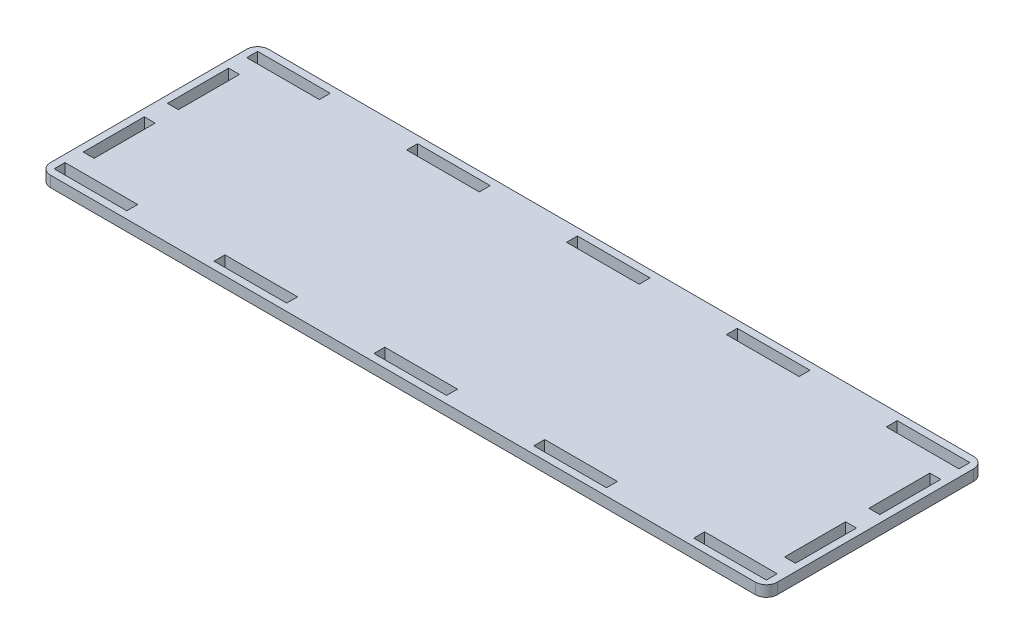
ISO-10303-21;
HEADER;
FILE_DESCRIPTION(('STEP AP214'),'2;1');
FILE_NAME('part.step','',(''),(''),'','','');
FILE_SCHEMA(('AUTOMOTIVE_DESIGN { 1 0 10303 214 1 1 1 1 }'));
ENDSEC;
DATA;
#1=APPLICATION_CONTEXT('core data for automotive mechanical design processes');
#2=APPLICATION_PROTOCOL_DEFINITION('international standard','automotive_design',2000,#1);
#3=PRODUCT_CONTEXT('',#1,'mechanical');
#4=PRODUCT('Part','Part','',(#3));
#5=PRODUCT_RELATED_PRODUCT_CATEGORY('part','',(#4));
#6=PRODUCT_DEFINITION_FORMATION('','',#4);
#7=PRODUCT_DEFINITION_CONTEXT('part definition',#1,'design');
#8=PRODUCT_DEFINITION('design','',#6,#7);
#9=PRODUCT_DEFINITION_SHAPE('','',#8);
#10=(LENGTH_UNIT() NAMED_UNIT(*) SI_UNIT(.MILLI.,.METRE.));
#11=(NAMED_UNIT(*) PLANE_ANGLE_UNIT() SI_UNIT($,.RADIAN.));
#12=(NAMED_UNIT(*) SI_UNIT($,.STERADIAN.) SOLID_ANGLE_UNIT());
#13=UNCERTAINTY_MEASURE_WITH_UNIT(LENGTH_MEASURE(1.E-05),#10,'distance_accuracy_value','');
#14=(GEOMETRIC_REPRESENTATION_CONTEXT(3) GLOBAL_UNCERTAINTY_ASSIGNED_CONTEXT((#13)) GLOBAL_UNIT_ASSIGNED_CONTEXT((#10,
#11,#12)) REPRESENTATION_CONTEXT('',''));
#15=CARTESIAN_POINT('',(0.,0.,0.));
#16=DIRECTION('',(0.,0.,1.));
#17=DIRECTION('',(1.,0.,0.));
#18=AXIS2_PLACEMENT_3D('',#15,#16,#17);
#19=CARTESIAN_POINT('',(197.,3.,57.));
#20=DIRECTION('',(0.,1.,0.));
#21=DIRECTION('',(0.,0.,1.));
#22=AXIS2_PLACEMENT_3D('',#19,#20,#21);
#23=PLANE('',#22);
#24=CARTESIAN_POINT('',(197.,3.,57.));
#25=DIRECTION('',(0.,1.,0.));
#26=DIRECTION('',(0.,0.,1.));
#27=AXIS2_PLACEMENT_3D('',#24,#25,#26);
#28=CIRCLE('',#27,3.);
#29=CARTESIAN_POINT('',(197.,3.,60.));
#30=VERTEX_POINT('',#29);
#31=CARTESIAN_POINT('',(200.,3.,57.));
#32=VERTEX_POINT('',#31);
#33=EDGE_CURVE('E872',#30,#32,#28,.T.);
#34=ORIENTED_EDGE('',*,*,#33,.T.);
#35=DIRECTION('',(0.,0.,-1.));
#36=VECTOR('',#35,1.);
#37=CARTESIAN_POINT('',(200.,3.,3.00000000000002));
#38=LINE('',#37,#36);
#39=CARTESIAN_POINT('',(200.,3.,3.00000000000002));
#40=VERTEX_POINT('',#39);
#41=EDGE_CURVE('E875',#32,#40,#38,.T.);
#42=ORIENTED_EDGE('',*,*,#41,.T.);
#43=CARTESIAN_POINT('',(197.,3.,3.));
#44=DIRECTION('',(0.,1.,0.));
#45=DIRECTION('',(0.,0.,-1.));
#46=AXIS2_PLACEMENT_3D('',#43,#44,#45);
#47=CIRCLE('',#46,3.);
#48=CARTESIAN_POINT('',(197.,3.,0.));
#49=VERTEX_POINT('',#48);
#50=EDGE_CURVE('E878',#40,#49,#47,.T.);
#51=ORIENTED_EDGE('',*,*,#50,.T.);
#52=DIRECTION('',(-1.,0.,0.));
#53=VECTOR('',#52,1.);
#54=CARTESIAN_POINT('',(3.00000000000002,3.,0.));
#55=LINE('',#54,#53);
#56=CARTESIAN_POINT('',(3.00000000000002,3.,0.));
#57=VERTEX_POINT('',#56);
#58=EDGE_CURVE('E880',#49,#57,#55,.T.);
#59=ORIENTED_EDGE('',*,*,#58,.T.);
#60=CARTESIAN_POINT('',(3.,3.,3.));
#61=DIRECTION('',(0.,1.,0.));
#62=DIRECTION('',(0.,0.,1.));
#63=AXIS2_PLACEMENT_3D('',#60,#61,#62);
#64=CIRCLE('',#63,3.);
#65=CARTESIAN_POINT('',(0.,3.,3.00000000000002));
#66=VERTEX_POINT('',#65);
#67=EDGE_CURVE('E882',#57,#66,#64,.T.);
#68=ORIENTED_EDGE('',*,*,#67,.T.);
#69=DIRECTION('',(0.,0.,1.));
#70=VECTOR('',#69,1.);
#71=CARTESIAN_POINT('',(0.,3.,3.00000000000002));
#72=LINE('',#71,#70);
#73=CARTESIAN_POINT('',(0.,3.,57.));
#74=VERTEX_POINT('',#73);
#75=EDGE_CURVE('E884',#66,#74,#72,.T.);
#76=ORIENTED_EDGE('',*,*,#75,.T.);
#77=CARTESIAN_POINT('',(3.00000000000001,3.,57.));
#78=DIRECTION('',(0.,1.,0.));
#79=DIRECTION('',(0.,0.,1.));
#80=AXIS2_PLACEMENT_3D('',#77,#78,#79);
#81=CIRCLE('',#80,3.);
#82=CARTESIAN_POINT('',(3.00000000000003,3.,60.));
#83=VERTEX_POINT('',#82);
#84=EDGE_CURVE('E886',#74,#83,#81,.T.);
#85=ORIENTED_EDGE('',*,*,#84,.T.);
#86=DIRECTION('',(1.,0.,0.));
#87=VECTOR('',#86,1.);
#88=CARTESIAN_POINT('',(3.00000000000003,3.,60.));
#89=LINE('',#88,#87);
#90=EDGE_CURVE('E888',#83,#30,#89,.T.);
#91=ORIENTED_EDGE('',*,*,#90,.T.);
#92=EDGE_LOOP('',(#34,#42,#51,#59,#68,#76,#85,#91));
#93=FACE_BOUND('',#92,.T.);
#94=DIRECTION('',(1.,0.,0.));
#95=VECTOR('',#94,1.);
#96=CARTESIAN_POINT('',(2.,3.,5.));
#97=LINE('',#96,#95);
#98=CARTESIAN_POINT('',(2.,3.,5.));
#99=VERTEX_POINT('',#98);
#100=CARTESIAN_POINT('',(22.,3.,5.));
#101=VERTEX_POINT('',#100);
#102=EDGE_CURVE('E843',#99,#101,#97,.T.);
#103=ORIENTED_EDGE('',*,*,#102,.F.);
#104=DIRECTION('',(0.,0.,1.));
#105=VECTOR('',#104,1.);
#106=CARTESIAN_POINT('',(2.,3.,2.));
#107=LINE('',#106,#105);
#108=CARTESIAN_POINT('',(2.,3.,2.));
#109=VERTEX_POINT('',#108);
#110=EDGE_CURVE('E841',#109,#99,#107,.T.);
#111=ORIENTED_EDGE('',*,*,#110,.F.);
#112=DIRECTION('',(-1.,0.,0.));
#113=VECTOR('',#112,1.);
#114=CARTESIAN_POINT('',(2.,3.,2.));
#115=LINE('',#114,#113);
#116=CARTESIAN_POINT('',(22.,3.,2.));
#117=VERTEX_POINT('',#116);
#118=EDGE_CURVE('E849',#117,#109,#115,.T.);
#119=ORIENTED_EDGE('',*,*,#118,.F.);
#120=DIRECTION('',(0.,0.,-1.));
#121=VECTOR('',#120,1.);
#122=CARTESIAN_POINT('',(22.,3.,2.));
#123=LINE('',#122,#121);
#124=EDGE_CURVE('E846',#101,#117,#123,.T.);
#125=ORIENTED_EDGE('',*,*,#124,.F.);
#126=EDGE_LOOP('',(#103,#111,#119,#125));
#127=FACE_BOUND('',#126,.T.);
#128=DIRECTION('',(1.,0.,0.));
#129=VECTOR('',#128,1.);
#130=CARTESIAN_POINT('',(195.,3.,26.8022662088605));
#131=LINE('',#130,#129);
#132=CARTESIAN_POINT('',(195.,3.,26.8022662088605));
#133=VERTEX_POINT('',#132);
#134=CARTESIAN_POINT('',(198.,3.,26.8022662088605));
#135=VERTEX_POINT('',#134);
#136=EDGE_CURVE('E812',#133,#135,#131,.T.);
#137=ORIENTED_EDGE('',*,*,#136,.F.);
#138=DIRECTION('',(0.,0.,1.));
#139=VECTOR('',#138,1.);
#140=CARTESIAN_POINT('',(195.,3.,10.));
#141=LINE('',#140,#139);
#142=CARTESIAN_POINT('',(195.,3.,10.));
#143=VERTEX_POINT('',#142);
#144=EDGE_CURVE('E810',#143,#133,#141,.T.);
#145=ORIENTED_EDGE('',*,*,#144,.F.);
#146=DIRECTION('',(-1.,0.,0.));
#147=VECTOR('',#146,1.);
#148=CARTESIAN_POINT('',(195.,3.,10.));
#149=LINE('',#148,#147);
#150=CARTESIAN_POINT('',(198.,3.,10.));
#151=VERTEX_POINT('',#150);
#152=EDGE_CURVE('E818',#151,#143,#149,.T.);
#153=ORIENTED_EDGE('',*,*,#152,.F.);
#154=DIRECTION('',(0.,0.,-1.));
#155=VECTOR('',#154,1.);
#156=CARTESIAN_POINT('',(198.,3.,10.));
#157=LINE('',#156,#155);
#158=EDGE_CURVE('E815',#135,#151,#157,.T.);
#159=ORIENTED_EDGE('',*,*,#158,.F.);
#160=EDGE_LOOP('',(#137,#145,#153,#159));
#161=FACE_BOUND('',#160,.T.);
#162=DIRECTION('',(1.,0.,0.));
#163=VECTOR('',#162,1.);
#164=CARTESIAN_POINT('',(46.0000000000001,3.,5.));
#165=LINE('',#164,#163);
#166=CARTESIAN_POINT('',(46.0000000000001,3.,5.));
#167=VERTEX_POINT('',#166);
#168=CARTESIAN_POINT('',(66.0000000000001,3.,5.));
#169=VERTEX_POINT('',#168);
#170=EDGE_CURVE('E781',#167,#169,#165,.T.);
#171=ORIENTED_EDGE('',*,*,#170,.F.);
#172=DIRECTION('',(0.,0.,1.));
#173=VECTOR('',#172,1.);
#174=CARTESIAN_POINT('',(46.0000000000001,3.,2.));
#175=LINE('',#174,#173);
#176=CARTESIAN_POINT('',(46.0000000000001,3.,2.));
#177=VERTEX_POINT('',#176);
#178=EDGE_CURVE('E779',#177,#167,#175,.T.);
#179=ORIENTED_EDGE('',*,*,#178,.F.);
#180=DIRECTION('',(-1.,0.,0.));
#181=VECTOR('',#180,1.);
#182=CARTESIAN_POINT('',(46.0000000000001,3.,2.));
#183=LINE('',#182,#181);
#184=CARTESIAN_POINT('',(66.0000000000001,3.,2.));
#185=VERTEX_POINT('',#184);
#186=EDGE_CURVE('E787',#185,#177,#183,.T.);
#187=ORIENTED_EDGE('',*,*,#186,.F.);
#188=DIRECTION('',(0.,0.,-1.));
#189=VECTOR('',#188,1.);
#190=CARTESIAN_POINT('',(66.0000000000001,3.,2.));
#191=LINE('',#190,#189);
#192=EDGE_CURVE('E784',#169,#185,#191,.T.);
#193=ORIENTED_EDGE('',*,*,#192,.F.);
#194=EDGE_LOOP('',(#171,#179,#187,#193));
#195=FACE_BOUND('',#194,.T.);
#196=DIRECTION('',(1.,0.,0.));
#197=VECTOR('',#196,1.);
#198=CARTESIAN_POINT('',(90.0000000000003,3.,5.));
#199=LINE('',#198,#197);
#200=CARTESIAN_POINT('',(90.0000000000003,3.,5.));
#201=VERTEX_POINT('',#200);
#202=CARTESIAN_POINT('',(110.,3.,5.));
#203=VERTEX_POINT('',#202);
#204=EDGE_CURVE('E750',#201,#203,#199,.T.);
#205=ORIENTED_EDGE('',*,*,#204,.F.);
#206=DIRECTION('',(0.,0.,1.));
#207=VECTOR('',#206,1.);
#208=CARTESIAN_POINT('',(90.0000000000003,3.,2.));
#209=LINE('',#208,#207);
#210=CARTESIAN_POINT('',(90.0000000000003,3.,2.));
#211=VERTEX_POINT('',#210);
#212=EDGE_CURVE('E748',#211,#201,#209,.T.);
#213=ORIENTED_EDGE('',*,*,#212,.F.);
#214=DIRECTION('',(-1.,0.,0.));
#215=VECTOR('',#214,1.);
#216=CARTESIAN_POINT('',(90.0000000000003,3.,2.));
#217=LINE('',#216,#215);
#218=CARTESIAN_POINT('',(110.,3.,2.));
#219=VERTEX_POINT('',#218);
#220=EDGE_CURVE('E756',#219,#211,#217,.T.);
#221=ORIENTED_EDGE('',*,*,#220,.F.);
#222=DIRECTION('',(0.,0.,-1.));
#223=VECTOR('',#222,1.);
#224=CARTESIAN_POINT('',(110.,3.,2.));
#225=LINE('',#224,#223);
#226=EDGE_CURVE('E753',#203,#219,#225,.T.);
#227=ORIENTED_EDGE('',*,*,#226,.F.);
#228=EDGE_LOOP('',(#205,#213,#221,#227));
#229=FACE_BOUND('',#228,.T.);
#230=DIRECTION('',(1.,0.,0.));
#231=VECTOR('',#230,1.);
#232=CARTESIAN_POINT('',(134.,3.,5.));
#233=LINE('',#232,#231);
#234=CARTESIAN_POINT('',(134.,3.,5.));
#235=VERTEX_POINT('',#234);
#236=CARTESIAN_POINT('',(154.,3.,5.));
#237=VERTEX_POINT('',#236);
#238=EDGE_CURVE('E719',#235,#237,#233,.T.);
#239=ORIENTED_EDGE('',*,*,#238,.F.);
#240=DIRECTION('',(0.,0.,1.));
#241=VECTOR('',#240,1.);
#242=CARTESIAN_POINT('',(134.,3.,2.));
#243=LINE('',#242,#241);
#244=CARTESIAN_POINT('',(134.,3.,2.));
#245=VERTEX_POINT('',#244);
#246=EDGE_CURVE('E717',#245,#235,#243,.T.);
#247=ORIENTED_EDGE('',*,*,#246,.F.);
#248=DIRECTION('',(-1.,0.,0.));
#249=VECTOR('',#248,1.);
#250=CARTESIAN_POINT('',(134.,3.,2.));
#251=LINE('',#250,#249);
#252=CARTESIAN_POINT('',(154.,3.,2.));
#253=VERTEX_POINT('',#252);
#254=EDGE_CURVE('E725',#253,#245,#251,.T.);
#255=ORIENTED_EDGE('',*,*,#254,.F.);
#256=DIRECTION('',(0.,0.,-1.));
#257=VECTOR('',#256,1.);
#258=CARTESIAN_POINT('',(154.,3.,2.));
#259=LINE('',#258,#257);
#260=EDGE_CURVE('E722',#237,#253,#259,.T.);
#261=ORIENTED_EDGE('',*,*,#260,.F.);
#262=EDGE_LOOP('',(#239,#247,#255,#261));
#263=FACE_BOUND('',#262,.T.);
#264=DIRECTION('',(1.,0.,0.));
#265=VECTOR('',#264,1.);
#266=CARTESIAN_POINT('',(178.000000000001,3.,5.));
#267=LINE('',#266,#265);
#268=CARTESIAN_POINT('',(178.000000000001,3.,5.));
#269=VERTEX_POINT('',#268);
#270=CARTESIAN_POINT('',(198.000000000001,3.,5.));
#271=VERTEX_POINT('',#270);
#272=EDGE_CURVE('E688',#269,#271,#267,.T.);
#273=ORIENTED_EDGE('',*,*,#272,.F.);
#274=DIRECTION('',(0.,0.,1.));
#275=VECTOR('',#274,1.);
#276=CARTESIAN_POINT('',(178.000000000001,3.,2.));
#277=LINE('',#276,#275);
#278=CARTESIAN_POINT('',(178.000000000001,3.,2.));
#279=VERTEX_POINT('',#278);
#280=EDGE_CURVE('E686',#279,#269,#277,.T.);
#281=ORIENTED_EDGE('',*,*,#280,.F.);
#282=DIRECTION('',(-1.,0.,0.));
#283=VECTOR('',#282,1.);
#284=CARTESIAN_POINT('',(178.000000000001,3.,2.));
#285=LINE('',#284,#283);
#286=CARTESIAN_POINT('',(198.000000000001,3.,1.99999999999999));
#287=VERTEX_POINT('',#286);
#288=EDGE_CURVE('E694',#287,#279,#285,.T.);
#289=ORIENTED_EDGE('',*,*,#288,.F.);
#290=DIRECTION('',(0.,0.,-1.));
#291=VECTOR('',#290,1.);
#292=CARTESIAN_POINT('',(198.000000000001,3.,2.));
#293=LINE('',#292,#291);
#294=EDGE_CURVE('E691',#271,#287,#293,.T.);
#295=ORIENTED_EDGE('',*,*,#294,.F.);
#296=EDGE_LOOP('',(#273,#281,#289,#295));
#297=FACE_BOUND('',#296,.T.);
#298=DIRECTION('',(1.,0.,0.));
#299=VECTOR('',#298,1.);
#300=CARTESIAN_POINT('',(46.0000000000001,3.,58.));
#301=LINE('',#300,#299);
#302=CARTESIAN_POINT('',(46.0000000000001,3.,58.));
#303=VERTEX_POINT('',#302);
#304=CARTESIAN_POINT('',(66.0000000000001,3.,58.));
#305=VERTEX_POINT('',#304);
#306=EDGE_CURVE('E657',#303,#305,#301,.T.);
#307=ORIENTED_EDGE('',*,*,#306,.F.);
#308=DIRECTION('',(0.,0.,1.));
#309=VECTOR('',#308,1.);
#310=CARTESIAN_POINT('',(46.0000000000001,3.,55.));
#311=LINE('',#310,#309);
#312=CARTESIAN_POINT('',(46.0000000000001,3.,55.));
#313=VERTEX_POINT('',#312);
#314=EDGE_CURVE('E655',#313,#303,#311,.T.);
#315=ORIENTED_EDGE('',*,*,#314,.F.);
#316=DIRECTION('',(-1.,0.,0.));
#317=VECTOR('',#316,1.);
#318=CARTESIAN_POINT('',(46.0000000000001,3.,55.));
#319=LINE('',#318,#317);
#320=CARTESIAN_POINT('',(66.0000000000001,3.,55.));
#321=VERTEX_POINT('',#320);
#322=EDGE_CURVE('E663',#321,#313,#319,.T.);
#323=ORIENTED_EDGE('',*,*,#322,.F.);
#324=DIRECTION('',(0.,0.,-1.));
#325=VECTOR('',#324,1.);
#326=CARTESIAN_POINT('',(66.0000000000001,3.,55.));
#327=LINE('',#326,#325);
#328=EDGE_CURVE('E660',#305,#321,#327,.T.);
#329=ORIENTED_EDGE('',*,*,#328,.F.);
#330=EDGE_LOOP('',(#307,#315,#323,#329));
#331=FACE_BOUND('',#330,.T.);
#332=DIRECTION('',(1.,0.,0.));
#333=VECTOR('',#332,1.);
#334=CARTESIAN_POINT('',(90.0000000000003,3.,58.));
#335=LINE('',#334,#333);
#336=CARTESIAN_POINT('',(90.0000000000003,3.,58.));
#337=VERTEX_POINT('',#336);
#338=CARTESIAN_POINT('',(110.,3.,58.));
#339=VERTEX_POINT('',#338);
#340=EDGE_CURVE('E626',#337,#339,#335,.T.);
#341=ORIENTED_EDGE('',*,*,#340,.F.);
#342=DIRECTION('',(0.,0.,1.));
#343=VECTOR('',#342,1.);
#344=CARTESIAN_POINT('',(90.0000000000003,3.,55.));
#345=LINE('',#344,#343);
#346=CARTESIAN_POINT('',(90.0000000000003,3.,55.));
#347=VERTEX_POINT('',#346);
#348=EDGE_CURVE('E624',#347,#337,#345,.T.);
#349=ORIENTED_EDGE('',*,*,#348,.F.);
#350=DIRECTION('',(-1.,0.,0.));
#351=VECTOR('',#350,1.);
#352=CARTESIAN_POINT('',(90.0000000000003,3.,55.));
#353=LINE('',#352,#351);
#354=CARTESIAN_POINT('',(110.,3.,55.));
#355=VERTEX_POINT('',#354);
#356=EDGE_CURVE('E632',#355,#347,#353,.T.);
#357=ORIENTED_EDGE('',*,*,#356,.F.);
#358=DIRECTION('',(0.,0.,-1.));
#359=VECTOR('',#358,1.);
#360=CARTESIAN_POINT('',(110.,3.,55.));
#361=LINE('',#360,#359);
#362=EDGE_CURVE('E629',#339,#355,#361,.T.);
#363=ORIENTED_EDGE('',*,*,#362,.F.);
#364=EDGE_LOOP('',(#341,#349,#357,#363));
#365=FACE_BOUND('',#364,.T.);
#366=DIRECTION('',(1.,0.,0.));
#367=VECTOR('',#366,1.);
#368=CARTESIAN_POINT('',(134.,3.,58.));
#369=LINE('',#368,#367);
#370=CARTESIAN_POINT('',(134.,3.,58.));
#371=VERTEX_POINT('',#370);
#372=CARTESIAN_POINT('',(154.,3.,58.));
#373=VERTEX_POINT('',#372);
#374=EDGE_CURVE('E595',#371,#373,#369,.T.);
#375=ORIENTED_EDGE('',*,*,#374,.F.);
#376=DIRECTION('',(0.,0.,1.));
#377=VECTOR('',#376,1.);
#378=CARTESIAN_POINT('',(134.,3.,55.));
#379=LINE('',#378,#377);
#380=CARTESIAN_POINT('',(134.,3.,55.));
#381=VERTEX_POINT('',#380);
#382=EDGE_CURVE('E593',#381,#371,#379,.T.);
#383=ORIENTED_EDGE('',*,*,#382,.F.);
#384=DIRECTION('',(-1.,0.,0.));
#385=VECTOR('',#384,1.);
#386=CARTESIAN_POINT('',(134.,3.,55.));
#387=LINE('',#386,#385);
#388=CARTESIAN_POINT('',(154.,3.,55.));
#389=VERTEX_POINT('',#388);
#390=EDGE_CURVE('E601',#389,#381,#387,.T.);
#391=ORIENTED_EDGE('',*,*,#390,.F.);
#392=DIRECTION('',(0.,0.,-1.));
#393=VECTOR('',#392,1.);
#394=CARTESIAN_POINT('',(154.,3.,55.));
#395=LINE('',#394,#393);
#396=EDGE_CURVE('E598',#373,#389,#395,.T.);
#397=ORIENTED_EDGE('',*,*,#396,.F.);
#398=EDGE_LOOP('',(#375,#383,#391,#397));
#399=FACE_BOUND('',#398,.T.);
#400=DIRECTION('',(1.,0.,0.));
#401=VECTOR('',#400,1.);
#402=CARTESIAN_POINT('',(178.000000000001,3.,58.));
#403=LINE('',#402,#401);
#404=CARTESIAN_POINT('',(178.000000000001,3.,58.));
#405=VERTEX_POINT('',#404);
#406=CARTESIAN_POINT('',(198.000000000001,3.,58.));
#407=VERTEX_POINT('',#406);
#408=EDGE_CURVE('E564',#405,#407,#403,.T.);
#409=ORIENTED_EDGE('',*,*,#408,.F.);
#410=DIRECTION('',(0.,0.,1.));
#411=VECTOR('',#410,1.);
#412=CARTESIAN_POINT('',(178.000000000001,3.,55.));
#413=LINE('',#412,#411);
#414=CARTESIAN_POINT('',(178.000000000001,3.,55.));
#415=VERTEX_POINT('',#414);
#416=EDGE_CURVE('E562',#415,#405,#413,.T.);
#417=ORIENTED_EDGE('',*,*,#416,.F.);
#418=DIRECTION('',(-1.,0.,0.));
#419=VECTOR('',#418,1.);
#420=CARTESIAN_POINT('',(178.000000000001,3.,55.));
#421=LINE('',#420,#419);
#422=CARTESIAN_POINT('',(198.000000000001,3.,55.));
#423=VERTEX_POINT('',#422);
#424=EDGE_CURVE('E570',#423,#415,#421,.T.);
#425=ORIENTED_EDGE('',*,*,#424,.F.);
#426=DIRECTION('',(0.,0.,-1.));
#427=VECTOR('',#426,1.);
#428=CARTESIAN_POINT('',(198.000000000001,3.,55.));
#429=LINE('',#428,#427);
#430=EDGE_CURVE('E567',#407,#423,#429,.T.);
#431=ORIENTED_EDGE('',*,*,#430,.F.);
#432=EDGE_LOOP('',(#409,#417,#425,#431));
#433=FACE_BOUND('',#432,.T.);
#434=DIRECTION('',(1.,0.,0.));
#435=VECTOR('',#434,1.);
#436=CARTESIAN_POINT('',(2.,3.,58.));
#437=LINE('',#436,#435);
#438=CARTESIAN_POINT('',(2.,3.,58.));
#439=VERTEX_POINT('',#438);
#440=CARTESIAN_POINT('',(22.,3.,58.));
#441=VERTEX_POINT('',#440);
#442=EDGE_CURVE('E533',#439,#441,#437,.T.);
#443=ORIENTED_EDGE('',*,*,#442,.F.);
#444=DIRECTION('',(0.,0.,1.));
#445=VECTOR('',#444,1.);
#446=CARTESIAN_POINT('',(2.,3.,55.));
#447=LINE('',#446,#445);
#448=CARTESIAN_POINT('',(2.,3.,55.));
#449=VERTEX_POINT('',#448);
#450=EDGE_CURVE('E531',#449,#439,#447,.T.);
#451=ORIENTED_EDGE('',*,*,#450,.F.);
#452=DIRECTION('',(-1.,0.,0.));
#453=VECTOR('',#452,1.);
#454=CARTESIAN_POINT('',(2.,3.,55.));
#455=LINE('',#454,#453);
#456=CARTESIAN_POINT('',(22.,3.,55.));
#457=VERTEX_POINT('',#456);
#458=EDGE_CURVE('E539',#457,#449,#455,.T.);
#459=ORIENTED_EDGE('',*,*,#458,.F.);
#460=DIRECTION('',(0.,0.,-1.));
#461=VECTOR('',#460,1.);
#462=CARTESIAN_POINT('',(22.,3.,55.));
#463=LINE('',#462,#461);
#464=EDGE_CURVE('E536',#441,#457,#463,.T.);
#465=ORIENTED_EDGE('',*,*,#464,.F.);
#466=EDGE_LOOP('',(#443,#451,#459,#465));
#467=FACE_BOUND('',#466,.T.);
#468=DIRECTION('',(1.,0.,0.));
#469=VECTOR('',#468,1.);
#470=CARTESIAN_POINT('',(2.,3.,26.8022662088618));
#471=LINE('',#470,#469);
#472=CARTESIAN_POINT('',(2.,3.,26.8022662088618));
#473=VERTEX_POINT('',#472);
#474=CARTESIAN_POINT('',(5.,3.,26.8022662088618));
#475=VERTEX_POINT('',#474);
#476=EDGE_CURVE('E502',#473,#475,#471,.T.);
#477=ORIENTED_EDGE('',*,*,#476,.F.);
#478=DIRECTION('',(0.,0.,1.));
#479=VECTOR('',#478,1.);
#480=CARTESIAN_POINT('',(2.,3.,10.0000000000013));
#481=LINE('',#480,#479);
#482=CARTESIAN_POINT('',(2.,3.,10.0000000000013));
#483=VERTEX_POINT('',#482);
#484=EDGE_CURVE('E500',#483,#473,#481,.T.);
#485=ORIENTED_EDGE('',*,*,#484,.F.);
#486=DIRECTION('',(-1.,0.,0.));
#487=VECTOR('',#486,1.);
#488=CARTESIAN_POINT('',(2.,3.,10.0000000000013));
#489=LINE('',#488,#487);
#490=CARTESIAN_POINT('',(5.,3.,10.0000000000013));
#491=VERTEX_POINT('',#490);
#492=EDGE_CURVE('E508',#491,#483,#489,.T.);
#493=ORIENTED_EDGE('',*,*,#492,.F.);
#494=DIRECTION('',(0.,0.,-1.));
#495=VECTOR('',#494,1.);
#496=CARTESIAN_POINT('',(5.,3.,10.0000000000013));
#497=LINE('',#496,#495);
#498=EDGE_CURVE('E505',#475,#491,#497,.T.);
#499=ORIENTED_EDGE('',*,*,#498,.F.);
#500=EDGE_LOOP('',(#477,#485,#493,#499));
#501=FACE_BOUND('',#500,.T.);
#502=DIRECTION('',(1.,0.,0.));
#503=VECTOR('',#502,1.);
#504=CARTESIAN_POINT('',(2.00000000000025,3.,50.0000000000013));
#505=LINE('',#504,#503);
#506=CARTESIAN_POINT('',(2.00000000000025,3.,50.0000000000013));
#507=VERTEX_POINT('',#506);
#508=CARTESIAN_POINT('',(5.00000000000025,3.,50.0000000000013));
#509=VERTEX_POINT('',#508);
#510=EDGE_CURVE('E471',#507,#509,#505,.T.);
#511=ORIENTED_EDGE('',*,*,#510,.F.);
#512=DIRECTION('',(0.,0.,1.));
#513=VECTOR('',#512,1.);
#514=CARTESIAN_POINT('',(2.00000000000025,3.,33.1977337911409));
#515=LINE('',#514,#513);
#516=CARTESIAN_POINT('',(2.00000000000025,3.,33.1977337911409));
#517=VERTEX_POINT('',#516);
#518=EDGE_CURVE('E469',#517,#507,#515,.T.);
#519=ORIENTED_EDGE('',*,*,#518,.F.);
#520=DIRECTION('',(-1.,0.,0.));
#521=VECTOR('',#520,1.);
#522=CARTESIAN_POINT('',(2.00000000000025,3.,33.1977337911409));
#523=LINE('',#522,#521);
#524=CARTESIAN_POINT('',(5.00000000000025,3.,33.1977337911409));
#525=VERTEX_POINT('',#524);
#526=EDGE_CURVE('E477',#525,#517,#523,.T.);
#527=ORIENTED_EDGE('',*,*,#526,.F.);
#528=DIRECTION('',(0.,0.,-1.));
#529=VECTOR('',#528,1.);
#530=CARTESIAN_POINT('',(5.00000000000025,3.,33.1977337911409));
#531=LINE('',#530,#529);
#532=EDGE_CURVE('E474',#509,#525,#531,.T.);
#533=ORIENTED_EDGE('',*,*,#532,.F.);
#534=EDGE_LOOP('',(#511,#519,#527,#533));
#535=FACE_BOUND('',#534,.T.);
#536=DIRECTION('',(1.,0.,0.));
#537=VECTOR('',#536,1.);
#538=CARTESIAN_POINT('',(195.,3.,50.));
#539=LINE('',#538,#537);
#540=CARTESIAN_POINT('',(195.,3.,50.));
#541=VERTEX_POINT('',#540);
#542=CARTESIAN_POINT('',(198.,3.,50.));
#543=VERTEX_POINT('',#542);
#544=EDGE_CURVE('E441',#541,#543,#539,.T.);
#545=ORIENTED_EDGE('',*,*,#544,.F.);
#546=DIRECTION('',(0.,0.,1.));
#547=VECTOR('',#546,1.);
#548=CARTESIAN_POINT('',(195.,3.,33.1977337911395));
#549=LINE('',#548,#547);
#550=CARTESIAN_POINT('',(195.,3.,33.1977337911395));
#551=VERTEX_POINT('',#550);
#552=EDGE_CURVE('E433',#551,#541,#549,.T.);
#553=ORIENTED_EDGE('',*,*,#552,.F.);
#554=DIRECTION('',(-1.,0.,0.));
#555=VECTOR('',#554,1.);
#556=CARTESIAN_POINT('',(195.,3.,33.1977337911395));
#557=LINE('',#556,#555);
#558=CARTESIAN_POINT('',(198.,3.,33.1977337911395));
#559=VERTEX_POINT('',#558);
#560=EDGE_CURVE('E455',#559,#551,#557,.T.);
#561=ORIENTED_EDGE('',*,*,#560,.F.);
#562=DIRECTION('',(0.,0.,-1.));
#563=VECTOR('',#562,1.);
#564=CARTESIAN_POINT('',(198.,3.,33.1977337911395));
#565=LINE('',#564,#563);
#566=EDGE_CURVE('E453',#543,#559,#565,.T.);
#567=ORIENTED_EDGE('',*,*,#566,.F.);
#568=EDGE_LOOP('',(#545,#553,#561,#567));
#569=FACE_BOUND('',#568,.T.);
#570=ADVANCED_FACE('F32',(#93,#127,#161,#195,#229,#263,#297,#331,#365,#399,#433,#467,#501,#535,
#569),#23,.T.);
#571=CARTESIAN_POINT('',(197.,0.,57.));
#572=DIRECTION('',(0.,1.,0.));
#573=DIRECTION('',(0.,0.,1.));
#574=AXIS2_PLACEMENT_3D('',#571,#572,#573);
#575=PLANE('',#574);
#576=DIRECTION('',(0.,0.,1.));
#577=VECTOR('',#576,1.);
#578=CARTESIAN_POINT('',(2.00000000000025,0.,33.1977337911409));
#579=LINE('',#578,#577);
#580=CARTESIAN_POINT('',(2.00000000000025,0.,33.1977337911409));
#581=VERTEX_POINT('',#580);
#582=CARTESIAN_POINT('',(2.00000000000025,0.,50.0000000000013));
#583=VERTEX_POINT('',#582);
#584=EDGE_CURVE('E449',#581,#583,#579,.T.);
#585=ORIENTED_EDGE('',*,*,#584,.T.);
#586=DIRECTION('',(1.,0.,0.));
#587=VECTOR('',#586,1.);
#588=CARTESIAN_POINT('',(2.00000000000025,0.,50.0000000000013));
#589=LINE('',#588,#587);
#590=CARTESIAN_POINT('',(5.00000000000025,0.,50.0000000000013));
#591=VERTEX_POINT('',#590);
#592=EDGE_CURVE('E482',#583,#591,#589,.T.);
#593=ORIENTED_EDGE('',*,*,#592,.T.);
#594=DIRECTION('',(0.,0.,-1.));
#595=VECTOR('',#594,1.);
#596=CARTESIAN_POINT('',(5.00000000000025,0.,33.1977337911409));
#597=LINE('',#596,#595);
#598=CARTESIAN_POINT('',(5.00000000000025,0.,33.1977337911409));
#599=VERTEX_POINT('',#598);
#600=EDGE_CURVE('E485',#591,#599,#597,.T.);
#601=ORIENTED_EDGE('',*,*,#600,.T.);
#602=DIRECTION('',(-1.,0.,0.));
#603=VECTOR('',#602,1.);
#604=CARTESIAN_POINT('',(2.00000000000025,0.,33.1977337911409));
#605=LINE('',#604,#603);
#606=EDGE_CURVE('E472',#599,#581,#605,.T.);
#607=ORIENTED_EDGE('',*,*,#606,.T.);
#608=EDGE_LOOP('',(#585,#593,#601,#607));
#609=FACE_BOUND('',#608,.T.);
#610=DIRECTION('',(0.,0.,1.));
#611=VECTOR('',#610,1.);
#612=CARTESIAN_POINT('',(2.,0.,55.));
#613=LINE('',#612,#611);
#614=CARTESIAN_POINT('',(2.,0.,55.));
#615=VERTEX_POINT('',#614);
#616=CARTESIAN_POINT('',(2.,0.,58.));
#617=VERTEX_POINT('',#616);
#618=EDGE_CURVE('E530',#615,#617,#613,.T.);
#619=ORIENTED_EDGE('',*,*,#618,.T.);
#620=DIRECTION('',(1.,0.,0.));
#621=VECTOR('',#620,1.);
#622=CARTESIAN_POINT('',(2.,0.,58.));
#623=LINE('',#622,#621);
#624=CARTESIAN_POINT('',(22.,0.,58.));
#625=VERTEX_POINT('',#624);
#626=EDGE_CURVE('E544',#617,#625,#623,.T.);
#627=ORIENTED_EDGE('',*,*,#626,.T.);
#628=DIRECTION('',(0.,0.,-1.));
#629=VECTOR('',#628,1.);
#630=CARTESIAN_POINT('',(22.,0.,55.));
#631=LINE('',#630,#629);
#632=CARTESIAN_POINT('',(22.,0.,55.));
#633=VERTEX_POINT('',#632);
#634=EDGE_CURVE('E547',#625,#633,#631,.T.);
#635=ORIENTED_EDGE('',*,*,#634,.T.);
#636=DIRECTION('',(-1.,0.,0.));
#637=VECTOR('',#636,1.);
#638=CARTESIAN_POINT('',(2.,0.,55.));
#639=LINE('',#638,#637);
#640=EDGE_CURVE('E534',#633,#615,#639,.T.);
#641=ORIENTED_EDGE('',*,*,#640,.T.);
#642=EDGE_LOOP('',(#619,#627,#635,#641));
#643=FACE_BOUND('',#642,.T.);
#644=DIRECTION('',(0.,0.,1.));
#645=VECTOR('',#644,1.);
#646=CARTESIAN_POINT('',(134.,0.,55.));
#647=LINE('',#646,#645);
#648=CARTESIAN_POINT('',(134.,0.,55.));
#649=VERTEX_POINT('',#648);
#650=CARTESIAN_POINT('',(134.,0.,58.));
#651=VERTEX_POINT('',#650);
#652=EDGE_CURVE('E592',#649,#651,#647,.T.);
#653=ORIENTED_EDGE('',*,*,#652,.T.);
#654=DIRECTION('',(1.,0.,0.));
#655=VECTOR('',#654,1.);
#656=CARTESIAN_POINT('',(134.,0.,58.));
#657=LINE('',#656,#655);
#658=CARTESIAN_POINT('',(154.,0.,58.));
#659=VERTEX_POINT('',#658);
#660=EDGE_CURVE('E606',#651,#659,#657,.T.);
#661=ORIENTED_EDGE('',*,*,#660,.T.);
#662=DIRECTION('',(0.,0.,-1.));
#663=VECTOR('',#662,1.);
#664=CARTESIAN_POINT('',(154.,0.,55.));
#665=LINE('',#664,#663);
#666=CARTESIAN_POINT('',(154.,0.,55.));
#667=VERTEX_POINT('',#666);
#668=EDGE_CURVE('E609',#659,#667,#665,.T.);
#669=ORIENTED_EDGE('',*,*,#668,.T.);
#670=DIRECTION('',(-1.,0.,0.));
#671=VECTOR('',#670,1.);
#672=CARTESIAN_POINT('',(134.,0.,55.));
#673=LINE('',#672,#671);
#674=EDGE_CURVE('E596',#667,#649,#673,.T.);
#675=ORIENTED_EDGE('',*,*,#674,.T.);
#676=EDGE_LOOP('',(#653,#661,#669,#675));
#677=FACE_BOUND('',#676,.T.);
#678=DIRECTION('',(0.,0.,1.));
#679=VECTOR('',#678,1.);
#680=CARTESIAN_POINT('',(46.0000000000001,0.,55.));
#681=LINE('',#680,#679);
#682=CARTESIAN_POINT('',(46.0000000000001,0.,55.));
#683=VERTEX_POINT('',#682);
#684=CARTESIAN_POINT('',(46.0000000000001,0.,58.));
#685=VERTEX_POINT('',#684);
#686=EDGE_CURVE('E654',#683,#685,#681,.T.);
#687=ORIENTED_EDGE('',*,*,#686,.T.);
#688=DIRECTION('',(1.,0.,0.));
#689=VECTOR('',#688,1.);
#690=CARTESIAN_POINT('',(46.0000000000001,0.,58.));
#691=LINE('',#690,#689);
#692=CARTESIAN_POINT('',(66.0000000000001,0.,58.));
#693=VERTEX_POINT('',#692);
#694=EDGE_CURVE('E668',#685,#693,#691,.T.);
#695=ORIENTED_EDGE('',*,*,#694,.T.);
#696=DIRECTION('',(0.,0.,-1.));
#697=VECTOR('',#696,1.);
#698=CARTESIAN_POINT('',(66.0000000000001,0.,55.));
#699=LINE('',#698,#697);
#700=CARTESIAN_POINT('',(66.0000000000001,0.,55.));
#701=VERTEX_POINT('',#700);
#702=EDGE_CURVE('E671',#693,#701,#699,.T.);
#703=ORIENTED_EDGE('',*,*,#702,.T.);
#704=DIRECTION('',(-1.,0.,0.));
#705=VECTOR('',#704,1.);
#706=CARTESIAN_POINT('',(46.0000000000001,0.,55.));
#707=LINE('',#706,#705);
#708=EDGE_CURVE('E658',#701,#683,#707,.T.);
#709=ORIENTED_EDGE('',*,*,#708,.T.);
#710=EDGE_LOOP('',(#687,#695,#703,#709));
#711=FACE_BOUND('',#710,.T.);
#712=DIRECTION('',(0.,0.,1.));
#713=VECTOR('',#712,1.);
#714=CARTESIAN_POINT('',(134.,0.,2.));
#715=LINE('',#714,#713);
#716=CARTESIAN_POINT('',(134.,0.,2.));
#717=VERTEX_POINT('',#716);
#718=CARTESIAN_POINT('',(134.,0.,5.));
#719=VERTEX_POINT('',#718);
#720=EDGE_CURVE('E716',#717,#719,#715,.T.);
#721=ORIENTED_EDGE('',*,*,#720,.T.);
#722=DIRECTION('',(1.,0.,0.));
#723=VECTOR('',#722,1.);
#724=CARTESIAN_POINT('',(134.,0.,5.));
#725=LINE('',#724,#723);
#726=CARTESIAN_POINT('',(154.,0.,5.));
#727=VERTEX_POINT('',#726);
#728=EDGE_CURVE('E730',#719,#727,#725,.T.);
#729=ORIENTED_EDGE('',*,*,#728,.T.);
#730=DIRECTION('',(0.,0.,-1.));
#731=VECTOR('',#730,1.);
#732=CARTESIAN_POINT('',(154.,0.,2.));
#733=LINE('',#732,#731);
#734=CARTESIAN_POINT('',(154.,0.,2.));
#735=VERTEX_POINT('',#734);
#736=EDGE_CURVE('E733',#727,#735,#733,.T.);
#737=ORIENTED_EDGE('',*,*,#736,.T.);
#738=DIRECTION('',(-1.,0.,0.));
#739=VECTOR('',#738,1.);
#740=CARTESIAN_POINT('',(134.,0.,2.));
#741=LINE('',#740,#739);
#742=EDGE_CURVE('E720',#735,#717,#741,.T.);
#743=ORIENTED_EDGE('',*,*,#742,.T.);
#744=EDGE_LOOP('',(#721,#729,#737,#743));
#745=FACE_BOUND('',#744,.T.);
#746=DIRECTION('',(0.,0.,1.));
#747=VECTOR('',#746,1.);
#748=CARTESIAN_POINT('',(46.0000000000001,0.,2.));
#749=LINE('',#748,#747);
#750=CARTESIAN_POINT('',(46.0000000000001,0.,2.));
#751=VERTEX_POINT('',#750);
#752=CARTESIAN_POINT('',(46.0000000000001,0.,5.));
#753=VERTEX_POINT('',#752);
#754=EDGE_CURVE('E778',#751,#753,#749,.T.);
#755=ORIENTED_EDGE('',*,*,#754,.T.);
#756=DIRECTION('',(1.,0.,0.));
#757=VECTOR('',#756,1.);
#758=CARTESIAN_POINT('',(46.0000000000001,0.,5.));
#759=LINE('',#758,#757);
#760=CARTESIAN_POINT('',(66.0000000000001,0.,5.));
#761=VERTEX_POINT('',#760);
#762=EDGE_CURVE('E792',#753,#761,#759,.T.);
#763=ORIENTED_EDGE('',*,*,#762,.T.);
#764=DIRECTION('',(0.,0.,-1.));
#765=VECTOR('',#764,1.);
#766=CARTESIAN_POINT('',(66.0000000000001,0.,2.));
#767=LINE('',#766,#765);
#768=CARTESIAN_POINT('',(66.0000000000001,0.,2.));
#769=VERTEX_POINT('',#768);
#770=EDGE_CURVE('E795',#761,#769,#767,.T.);
#771=ORIENTED_EDGE('',*,*,#770,.T.);
#772=DIRECTION('',(-1.,0.,0.));
#773=VECTOR('',#772,1.);
#774=CARTESIAN_POINT('',(46.0000000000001,0.,2.));
#775=LINE('',#774,#773);
#776=EDGE_CURVE('E782',#769,#751,#775,.T.);
#777=ORIENTED_EDGE('',*,*,#776,.T.);
#778=EDGE_LOOP('',(#755,#763,#771,#777));
#779=FACE_BOUND('',#778,.T.);
#780=DIRECTION('',(0.,0.,1.));
#781=VECTOR('',#780,1.);
#782=CARTESIAN_POINT('',(2.,0.,2.));
#783=LINE('',#782,#781);
#784=CARTESIAN_POINT('',(2.,0.,2.));
#785=VERTEX_POINT('',#784);
#786=CARTESIAN_POINT('',(2.,0.,5.));
#787=VERTEX_POINT('',#786);
#788=EDGE_CURVE('E840',#785,#787,#783,.T.);
#789=ORIENTED_EDGE('',*,*,#788,.T.);
#790=DIRECTION('',(1.,0.,0.));
#791=VECTOR('',#790,1.);
#792=CARTESIAN_POINT('',(2.,0.,5.));
#793=LINE('',#792,#791);
#794=CARTESIAN_POINT('',(22.,0.,5.));
#795=VERTEX_POINT('',#794);
#796=EDGE_CURVE('E854',#787,#795,#793,.T.);
#797=ORIENTED_EDGE('',*,*,#796,.T.);
#798=DIRECTION('',(0.,0.,-1.));
#799=VECTOR('',#798,1.);
#800=CARTESIAN_POINT('',(22.,0.,2.));
#801=LINE('',#800,#799);
#802=CARTESIAN_POINT('',(22.,0.,2.));
#803=VERTEX_POINT('',#802);
#804=EDGE_CURVE('E857',#795,#803,#801,.T.);
#805=ORIENTED_EDGE('',*,*,#804,.T.);
#806=DIRECTION('',(-1.,0.,0.));
#807=VECTOR('',#806,1.);
#808=CARTESIAN_POINT('',(2.,0.,2.));
#809=LINE('',#808,#807);
#810=EDGE_CURVE('E844',#803,#785,#809,.T.);
#811=ORIENTED_EDGE('',*,*,#810,.T.);
#812=EDGE_LOOP('',(#789,#797,#805,#811));
#813=FACE_BOUND('',#812,.T.);
#814=CARTESIAN_POINT('',(197.,0.,57.));
#815=DIRECTION('',(0.,1.,0.));
#816=DIRECTION('',(0.,0.,1.));
#817=AXIS2_PLACEMENT_3D('',#814,#815,#816);
#818=CIRCLE('',#817,3.);
#819=CARTESIAN_POINT('',(197.,0.,60.));
#820=VERTEX_POINT('',#819);
#821=CARTESIAN_POINT('',(200.,0.,57.));
#822=VERTEX_POINT('',#821);
#823=EDGE_CURVE('E871',#820,#822,#818,.T.);
#824=ORIENTED_EDGE('',*,*,#823,.F.);
#825=DIRECTION('',(1.,0.,0.));
#826=VECTOR('',#825,1.);
#827=CARTESIAN_POINT('',(3.00000000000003,0.,60.));
#828=LINE('',#827,#826);
#829=CARTESIAN_POINT('',(3.00000000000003,0.,60.));
#830=VERTEX_POINT('',#829);
#831=EDGE_CURVE('E876',#830,#820,#828,.T.);
#832=ORIENTED_EDGE('',*,*,#831,.F.);
#833=CARTESIAN_POINT('',(3.00000000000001,0.,57.));
#834=DIRECTION('',(0.,1.,0.));
#835=DIRECTION('',(0.,0.,1.));
#836=AXIS2_PLACEMENT_3D('',#833,#834,#835);
#837=CIRCLE('',#836,3.);
#838=CARTESIAN_POINT('',(0.,0.,57.));
#839=VERTEX_POINT('',#838);
#840=EDGE_CURVE('E903',#839,#830,#837,.T.);
#841=ORIENTED_EDGE('',*,*,#840,.F.);
#842=DIRECTION('',(0.,0.,1.));
#843=VECTOR('',#842,1.);
#844=CARTESIAN_POINT('',(0.,0.,3.00000000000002));
#845=LINE('',#844,#843);
#846=CARTESIAN_POINT('',(0.,0.,3.00000000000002));
#847=VERTEX_POINT('',#846);
#848=EDGE_CURVE('E901',#847,#839,#845,.T.);
#849=ORIENTED_EDGE('',*,*,#848,.F.);
#850=CARTESIAN_POINT('',(3.,0.,3.));
#851=DIRECTION('',(0.,1.,0.));
#852=DIRECTION('',(0.,0.,1.));
#853=AXIS2_PLACEMENT_3D('',#850,#851,#852);
#854=CIRCLE('',#853,3.);
#855=CARTESIAN_POINT('',(3.00000000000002,0.,0.));
#856=VERTEX_POINT('',#855);
#857=EDGE_CURVE('E899',#856,#847,#854,.T.);
#858=ORIENTED_EDGE('',*,*,#857,.F.);
#859=DIRECTION('',(-1.,0.,0.));
#860=VECTOR('',#859,1.);
#861=CARTESIAN_POINT('',(3.00000000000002,0.,0.));
#862=LINE('',#861,#860);
#863=CARTESIAN_POINT('',(197.,0.,0.));
#864=VERTEX_POINT('',#863);
#865=EDGE_CURVE('E897',#864,#856,#862,.T.);
#866=ORIENTED_EDGE('',*,*,#865,.F.);
#867=CARTESIAN_POINT('',(197.,0.,3.));
#868=DIRECTION('',(0.,1.,0.));
#869=DIRECTION('',(0.,0.,-1.));
#870=AXIS2_PLACEMENT_3D('',#867,#868,#869);
#871=CIRCLE('',#870,3.);
#872=CARTESIAN_POINT('',(200.,0.,3.00000000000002));
#873=VERTEX_POINT('',#872);
#874=EDGE_CURVE('E895',#873,#864,#871,.T.);
#875=ORIENTED_EDGE('',*,*,#874,.F.);
#876=DIRECTION('',(0.,0.,-1.));
#877=VECTOR('',#876,1.);
#878=CARTESIAN_POINT('',(200.,0.,3.00000000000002));
#879=LINE('',#878,#877);
#880=EDGE_CURVE('E893',#822,#873,#879,.T.);
#881=ORIENTED_EDGE('',*,*,#880,.F.);
#882=EDGE_LOOP('',(#824,#832,#841,#849,#858,#866,#875,#881));
#883=FACE_BOUND('',#882,.T.);
#884=DIRECTION('',(0.,0.,1.));
#885=VECTOR('',#884,1.);
#886=CARTESIAN_POINT('',(195.,0.,10.));
#887=LINE('',#886,#885);
#888=CARTESIAN_POINT('',(195.,0.,10.));
#889=VERTEX_POINT('',#888);
#890=CARTESIAN_POINT('',(195.,0.,26.8022662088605));
#891=VERTEX_POINT('',#890);
#892=EDGE_CURVE('E809',#889,#891,#887,.T.);
#893=ORIENTED_EDGE('',*,*,#892,.T.);
#894=DIRECTION('',(1.,0.,0.));
#895=VECTOR('',#894,1.);
#896=CARTESIAN_POINT('',(195.,0.,26.8022662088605));
#897=LINE('',#896,#895);
#898=CARTESIAN_POINT('',(198.,0.,26.8022662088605));
#899=VERTEX_POINT('',#898);
#900=EDGE_CURVE('E823',#891,#899,#897,.T.);
#901=ORIENTED_EDGE('',*,*,#900,.T.);
#902=DIRECTION('',(0.,0.,-1.));
#903=VECTOR('',#902,1.);
#904=CARTESIAN_POINT('',(198.,0.,10.));
#905=LINE('',#904,#903);
#906=CARTESIAN_POINT('',(198.,0.,10.));
#907=VERTEX_POINT('',#906);
#908=EDGE_CURVE('E826',#899,#907,#905,.T.);
#909=ORIENTED_EDGE('',*,*,#908,.T.);
#910=DIRECTION('',(-1.,0.,0.));
#911=VECTOR('',#910,1.);
#912=CARTESIAN_POINT('',(195.,0.,10.));
#913=LINE('',#912,#911);
#914=EDGE_CURVE('E813',#907,#889,#913,.T.);
#915=ORIENTED_EDGE('',*,*,#914,.T.);
#916=EDGE_LOOP('',(#893,#901,#909,#915));
#917=FACE_BOUND('',#916,.T.);
#918=DIRECTION('',(0.,0.,1.));
#919=VECTOR('',#918,1.);
#920=CARTESIAN_POINT('',(90.0000000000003,0.,2.));
#921=LINE('',#920,#919);
#922=CARTESIAN_POINT('',(90.0000000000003,0.,2.));
#923=VERTEX_POINT('',#922);
#924=CARTESIAN_POINT('',(90.0000000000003,0.,5.));
#925=VERTEX_POINT('',#924);
#926=EDGE_CURVE('E747',#923,#925,#921,.T.);
#927=ORIENTED_EDGE('',*,*,#926,.T.);
#928=DIRECTION('',(1.,0.,0.));
#929=VECTOR('',#928,1.);
#930=CARTESIAN_POINT('',(90.0000000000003,0.,5.));
#931=LINE('',#930,#929);
#932=CARTESIAN_POINT('',(110.,0.,5.));
#933=VERTEX_POINT('',#932);
#934=EDGE_CURVE('E761',#925,#933,#931,.T.);
#935=ORIENTED_EDGE('',*,*,#934,.T.);
#936=DIRECTION('',(0.,0.,-1.));
#937=VECTOR('',#936,1.);
#938=CARTESIAN_POINT('',(110.,0.,2.));
#939=LINE('',#938,#937);
#940=CARTESIAN_POINT('',(110.,0.,2.));
#941=VERTEX_POINT('',#940);
#942=EDGE_CURVE('E764',#933,#941,#939,.T.);
#943=ORIENTED_EDGE('',*,*,#942,.T.);
#944=DIRECTION('',(-1.,0.,0.));
#945=VECTOR('',#944,1.);
#946=CARTESIAN_POINT('',(90.0000000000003,0.,2.));
#947=LINE('',#946,#945);
#948=EDGE_CURVE('E751',#941,#923,#947,.T.);
#949=ORIENTED_EDGE('',*,*,#948,.T.);
#950=EDGE_LOOP('',(#927,#935,#943,#949));
#951=FACE_BOUND('',#950,.T.);
#952=DIRECTION('',(0.,0.,1.));
#953=VECTOR('',#952,1.);
#954=CARTESIAN_POINT('',(178.000000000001,0.,2.));
#955=LINE('',#954,#953);
#956=CARTESIAN_POINT('',(178.000000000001,0.,1.99999999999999));
#957=VERTEX_POINT('',#956);
#958=CARTESIAN_POINT('',(178.000000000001,0.,5.));
#959=VERTEX_POINT('',#958);
#960=EDGE_CURVE('E685',#957,#959,#955,.T.);
#961=ORIENTED_EDGE('',*,*,#960,.T.);
#962=DIRECTION('',(1.,0.,0.));
#963=VECTOR('',#962,1.);
#964=CARTESIAN_POINT('',(178.000000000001,0.,5.));
#965=LINE('',#964,#963);
#966=CARTESIAN_POINT('',(198.000000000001,0.,5.));
#967=VERTEX_POINT('',#966);
#968=EDGE_CURVE('E699',#959,#967,#965,.T.);
#969=ORIENTED_EDGE('',*,*,#968,.T.);
#970=DIRECTION('',(0.,0.,-1.));
#971=VECTOR('',#970,1.);
#972=CARTESIAN_POINT('',(198.000000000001,0.,2.));
#973=LINE('',#972,#971);
#974=CARTESIAN_POINT('',(198.000000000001,0.,2.));
#975=VERTEX_POINT('',#974);
#976=EDGE_CURVE('E702',#967,#975,#973,.T.);
#977=ORIENTED_EDGE('',*,*,#976,.T.);
#978=DIRECTION('',(-1.,0.,0.));
#979=VECTOR('',#978,1.);
#980=CARTESIAN_POINT('',(178.000000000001,0.,2.));
#981=LINE('',#980,#979);
#982=EDGE_CURVE('E689',#975,#957,#981,.T.);
#983=ORIENTED_EDGE('',*,*,#982,.T.);
#984=EDGE_LOOP('',(#961,#969,#977,#983));
#985=FACE_BOUND('',#984,.T.);
#986=DIRECTION('',(0.,0.,1.));
#987=VECTOR('',#986,1.);
#988=CARTESIAN_POINT('',(90.0000000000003,0.,55.));
#989=LINE('',#988,#987);
#990=CARTESIAN_POINT('',(90.0000000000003,0.,55.));
#991=VERTEX_POINT('',#990);
#992=CARTESIAN_POINT('',(90.0000000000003,0.,58.));
#993=VERTEX_POINT('',#992);
#994=EDGE_CURVE('E623',#991,#993,#989,.T.);
#995=ORIENTED_EDGE('',*,*,#994,.T.);
#996=DIRECTION('',(1.,0.,0.));
#997=VECTOR('',#996,1.);
#998=CARTESIAN_POINT('',(90.0000000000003,0.,58.));
#999=LINE('',#998,#997);
#1000=CARTESIAN_POINT('',(110.,0.,58.));
#1001=VERTEX_POINT('',#1000);
#1002=EDGE_CURVE('E637',#993,#1001,#999,.T.);
#1003=ORIENTED_EDGE('',*,*,#1002,.T.);
#1004=DIRECTION('',(0.,0.,-1.));
#1005=VECTOR('',#1004,1.);
#1006=CARTESIAN_POINT('',(110.,0.,55.));
#1007=LINE('',#1006,#1005);
#1008=CARTESIAN_POINT('',(110.,0.,55.));
#1009=VERTEX_POINT('',#1008);
#1010=EDGE_CURVE('E640',#1001,#1009,#1007,.T.);
#1011=ORIENTED_EDGE('',*,*,#1010,.T.);
#1012=DIRECTION('',(-1.,0.,0.));
#1013=VECTOR('',#1012,1.);
#1014=CARTESIAN_POINT('',(90.0000000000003,0.,55.));
#1015=LINE('',#1014,#1013);
#1016=EDGE_CURVE('E627',#1009,#991,#1015,.T.);
#1017=ORIENTED_EDGE('',*,*,#1016,.T.);
#1018=EDGE_LOOP('',(#995,#1003,#1011,#1017));
#1019=FACE_BOUND('',#1018,.T.);
#1020=DIRECTION('',(0.,0.,1.));
#1021=VECTOR('',#1020,1.);
#1022=CARTESIAN_POINT('',(178.000000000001,0.,55.));
#1023=LINE('',#1022,#1021);
#1024=CARTESIAN_POINT('',(178.000000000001,0.,55.));
#1025=VERTEX_POINT('',#1024);
#1026=CARTESIAN_POINT('',(178.000000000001,0.,58.));
#1027=VERTEX_POINT('',#1026);
#1028=EDGE_CURVE('E561',#1025,#1027,#1023,.T.);
#1029=ORIENTED_EDGE('',*,*,#1028,.T.);
#1030=DIRECTION('',(1.,0.,0.));
#1031=VECTOR('',#1030,1.);
#1032=CARTESIAN_POINT('',(178.000000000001,0.,58.));
#1033=LINE('',#1032,#1031);
#1034=CARTESIAN_POINT('',(198.000000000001,0.,58.));
#1035=VERTEX_POINT('',#1034);
#1036=EDGE_CURVE('E575',#1027,#1035,#1033,.T.);
#1037=ORIENTED_EDGE('',*,*,#1036,.T.);
#1038=DIRECTION('',(0.,0.,-1.));
#1039=VECTOR('',#1038,1.);
#1040=CARTESIAN_POINT('',(198.000000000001,0.,55.));
#1041=LINE('',#1040,#1039);
#1042=CARTESIAN_POINT('',(198.000000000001,0.,55.));
#1043=VERTEX_POINT('',#1042);
#1044=EDGE_CURVE('E578',#1035,#1043,#1041,.T.);
#1045=ORIENTED_EDGE('',*,*,#1044,.T.);
#1046=DIRECTION('',(-1.,0.,0.));
#1047=VECTOR('',#1046,1.);
#1048=CARTESIAN_POINT('',(178.000000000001,0.,55.));
#1049=LINE('',#1048,#1047);
#1050=EDGE_CURVE('E565',#1043,#1025,#1049,.T.);
#1051=ORIENTED_EDGE('',*,*,#1050,.T.);
#1052=EDGE_LOOP('',(#1029,#1037,#1045,#1051));
#1053=FACE_BOUND('',#1052,.T.);
#1054=DIRECTION('',(0.,0.,1.));
#1055=VECTOR('',#1054,1.);
#1056=CARTESIAN_POINT('',(2.,0.,10.0000000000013));
#1057=LINE('',#1056,#1055);
#1058=CARTESIAN_POINT('',(2.,0.,10.0000000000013));
#1059=VERTEX_POINT('',#1058);
#1060=CARTESIAN_POINT('',(2.,0.,26.8022662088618));
#1061=VERTEX_POINT('',#1060);
#1062=EDGE_CURVE('E499',#1059,#1061,#1057,.T.);
#1063=ORIENTED_EDGE('',*,*,#1062,.T.);
#1064=DIRECTION('',(1.,0.,0.));
#1065=VECTOR('',#1064,1.);
#1066=CARTESIAN_POINT('',(2.,0.,26.8022662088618));
#1067=LINE('',#1066,#1065);
#1068=CARTESIAN_POINT('',(5.,0.,26.8022662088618));
#1069=VERTEX_POINT('',#1068);
#1070=EDGE_CURVE('E513',#1061,#1069,#1067,.T.);
#1071=ORIENTED_EDGE('',*,*,#1070,.T.);
#1072=DIRECTION('',(0.,0.,-1.));
#1073=VECTOR('',#1072,1.);
#1074=CARTESIAN_POINT('',(5.,0.,10.0000000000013));
#1075=LINE('',#1074,#1073);
#1076=CARTESIAN_POINT('',(5.,0.,10.0000000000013));
#1077=VERTEX_POINT('',#1076);
#1078=EDGE_CURVE('E516',#1069,#1077,#1075,.T.);
#1079=ORIENTED_EDGE('',*,*,#1078,.T.);
#1080=DIRECTION('',(-1.,0.,0.));
#1081=VECTOR('',#1080,1.);
#1082=CARTESIAN_POINT('',(2.,0.,10.0000000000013));
#1083=LINE('',#1082,#1081);
#1084=EDGE_CURVE('E503',#1077,#1059,#1083,.T.);
#1085=ORIENTED_EDGE('',*,*,#1084,.T.);
#1086=EDGE_LOOP('',(#1063,#1071,#1079,#1085));
#1087=FACE_BOUND('',#1086,.T.);
#1088=DIRECTION('',(0.,0.,1.));
#1089=VECTOR('',#1088,1.);
#1090=CARTESIAN_POINT('',(195.,0.,33.1977337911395));
#1091=LINE('',#1090,#1089);
#1092=CARTESIAN_POINT('',(195.,0.,33.1977337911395));
#1093=VERTEX_POINT('',#1092);
#1094=CARTESIAN_POINT('',(195.,0.,50.));
#1095=VERTEX_POINT('',#1094);
#1096=EDGE_CURVE('E55',#1093,#1095,#1091,.T.);
#1097=ORIENTED_EDGE('',*,*,#1096,.T.);
#1098=DIRECTION('',(1.,0.,0.));
#1099=VECTOR('',#1098,1.);
#1100=CARTESIAN_POINT('',(195.,0.,50.));
#1101=LINE('',#1100,#1099);
#1102=CARTESIAN_POINT('',(198.,0.,50.));
#1103=VERTEX_POINT('',#1102);
#1104=EDGE_CURVE('E448',#1095,#1103,#1101,.T.);
#1105=ORIENTED_EDGE('',*,*,#1104,.T.);
#1106=DIRECTION('',(0.,0.,-1.));
#1107=VECTOR('',#1106,1.);
#1108=CARTESIAN_POINT('',(198.,0.,33.1977337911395));
#1109=LINE('',#1108,#1107);
#1110=CARTESIAN_POINT('',(198.,0.,33.1977337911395));
#1111=VERTEX_POINT('',#1110);
#1112=EDGE_CURVE('E461',#1103,#1111,#1109,.T.);
#1113=ORIENTED_EDGE('',*,*,#1112,.T.);
#1114=DIRECTION('',(-1.,0.,0.));
#1115=VECTOR('',#1114,1.);
#1116=CARTESIAN_POINT('',(195.,0.,33.1977337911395));
#1117=LINE('',#1116,#1115);
#1118=EDGE_CURVE('E442',#1111,#1093,#1117,.T.);
#1119=ORIENTED_EDGE('',*,*,#1118,.T.);
#1120=EDGE_LOOP('',(#1097,#1105,#1113,#1119));
#1121=FACE_BOUND('',#1120,.T.);
#1122=ADVANCED_FACE('F933',(#609,#643,#677,#711,#745,#779,#813,#883,#917,#951,#985,#1019,#1053,
#1087,#1121),#575,.F.);
#1123=CARTESIAN_POINT('',(197.,3.,57.));
#1124=DIRECTION('',(0.,-1.,0.));
#1125=DIRECTION('',(0.,0.,-1.));
#1126=AXIS2_PLACEMENT_3D('',#1123,#1124,#1125);
#1127=CYLINDRICAL_SURFACE('',#1126,3.);
#1128=ORIENTED_EDGE('',*,*,#823,.T.);
#1129=DIRECTION('',(0.,-1.,0.));
#1130=VECTOR('',#1129,1.);
#1131=CARTESIAN_POINT('',(200.,3.,57.));
#1132=LINE('',#1131,#1130);
#1133=EDGE_CURVE('E11',#32,#822,#1132,.T.);
#1134=ORIENTED_EDGE('',*,*,#1133,.F.);
#1135=ORIENTED_EDGE('',*,*,#33,.F.);
#1136=DIRECTION('',(0.,-1.,0.));
#1137=VECTOR('',#1136,1.);
#1138=CARTESIAN_POINT('',(197.,3.,60.));
#1139=LINE('',#1138,#1137);
#1140=EDGE_CURVE('E890',#30,#820,#1139,.T.);
#1141=ORIENTED_EDGE('',*,*,#1140,.T.);
#1142=EDGE_LOOP('',(#1128,#1134,#1135,#1141));
#1143=FACE_BOUND('',#1142,.T.);
#1144=ADVANCED_FACE('F34',(#1143),#1127,.T.);
#1145=CARTESIAN_POINT('',(200.,3.,3.00000000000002));
#1146=DIRECTION('',(-1.,0.,0.));
#1147=DIRECTION('',(0.,0.,1.));
#1148=AXIS2_PLACEMENT_3D('',#1145,#1146,#1147);
#1149=PLANE('',#1148);
#1150=ORIENTED_EDGE('',*,*,#880,.T.);
#1151=DIRECTION('',(0.,-1.,0.));
#1152=VECTOR('',#1151,1.);
#1153=CARTESIAN_POINT('',(200.,3.,3.00000000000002));
#1154=LINE('',#1153,#1152);
#1155=EDGE_CURVE('E40',#40,#873,#1154,.T.);
#1156=ORIENTED_EDGE('',*,*,#1155,.F.);
#1157=ORIENTED_EDGE('',*,*,#41,.F.);
#1158=ORIENTED_EDGE('',*,*,#1133,.T.);
#1159=EDGE_LOOP('',(#1150,#1156,#1157,#1158));
#1160=FACE_BOUND('',#1159,.T.);
#1161=ADVANCED_FACE('F951',(#1160),#1149,.F.);
#1162=CARTESIAN_POINT('',(197.,3.,3.));
#1163=DIRECTION('',(0.,-1.,0.));
#1164=DIRECTION('',(0.,0.,-1.));
#1165=AXIS2_PLACEMENT_3D('',#1162,#1163,#1164);
#1166=CYLINDRICAL_SURFACE('',#1165,3.);
#1167=ORIENTED_EDGE('',*,*,#874,.T.);
#1168=DIRECTION('',(0.,-1.,0.));
#1169=VECTOR('',#1168,1.);
#1170=CARTESIAN_POINT('',(197.,3.,0.));
#1171=LINE('',#1170,#1169);
#1172=EDGE_CURVE('E920',#49,#864,#1171,.T.);
#1173=ORIENTED_EDGE('',*,*,#1172,.F.);
#1174=ORIENTED_EDGE('',*,*,#50,.F.);
#1175=ORIENTED_EDGE('',*,*,#1155,.T.);
#1176=EDGE_LOOP('',(#1167,#1173,#1174,#1175));
#1177=FACE_BOUND('',#1176,.T.);
#1178=ADVANCED_FACE('F927',(#1177),#1166,.T.);
#1179=CARTESIAN_POINT('',(3.00000000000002,3.,0.));
#1180=DIRECTION('',(0.,0.,1.));
#1181=DIRECTION('',(1.,0.,0.));
#1182=AXIS2_PLACEMENT_3D('',#1179,#1180,#1181);
#1183=PLANE('',#1182);
#1184=ORIENTED_EDGE('',*,*,#865,.T.);
#1185=DIRECTION('',(0.,-1.,0.));
#1186=VECTOR('',#1185,1.);
#1187=CARTESIAN_POINT('',(3.00000000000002,3.,0.));
#1188=LINE('',#1187,#1186);
#1189=EDGE_CURVE('E917',#57,#856,#1188,.T.);
#1190=ORIENTED_EDGE('',*,*,#1189,.F.);
#1191=ORIENTED_EDGE('',*,*,#58,.F.);
#1192=ORIENTED_EDGE('',*,*,#1172,.T.);
#1193=EDGE_LOOP('',(#1184,#1190,#1191,#1192));
#1194=FACE_BOUND('',#1193,.T.);
#1195=ADVANCED_FACE('F939',(#1194),#1183,.F.);
#1196=CARTESIAN_POINT('',(3.,3.,3.));
#1197=DIRECTION('',(0.,-1.,0.));
#1198=DIRECTION('',(0.,0.,-1.));
#1199=AXIS2_PLACEMENT_3D('',#1196,#1197,#1198);
#1200=CYLINDRICAL_SURFACE('',#1199,3.);
#1201=ORIENTED_EDGE('',*,*,#857,.T.);
#1202=DIRECTION('',(0.,-1.,0.));
#1203=VECTOR('',#1202,1.);
#1204=CARTESIAN_POINT('',(0.,3.,3.00000000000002));
#1205=LINE('',#1204,#1203);
#1206=EDGE_CURVE('E914',#66,#847,#1205,.T.);
#1207=ORIENTED_EDGE('',*,*,#1206,.F.);
#1208=ORIENTED_EDGE('',*,*,#67,.F.);
#1209=ORIENTED_EDGE('',*,*,#1189,.T.);
#1210=EDGE_LOOP('',(#1201,#1207,#1208,#1209));
#1211=FACE_BOUND('',#1210,.T.);
#1212=ADVANCED_FACE('F943',(#1211),#1200,.T.);
#1213=CARTESIAN_POINT('',(0.,3.,3.00000000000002));
#1214=DIRECTION('',(1.,0.,0.));
#1215=DIRECTION('',(0.,0.,-1.));
#1216=AXIS2_PLACEMENT_3D('',#1213,#1214,#1215);
#1217=PLANE('',#1216);
#1218=ORIENTED_EDGE('',*,*,#848,.T.);
#1219=DIRECTION('',(0.,-1.,0.));
#1220=VECTOR('',#1219,1.);
#1221=CARTESIAN_POINT('',(0.,3.,57.));
#1222=LINE('',#1221,#1220);
#1223=EDGE_CURVE('E911',#74,#839,#1222,.T.);
#1224=ORIENTED_EDGE('',*,*,#1223,.F.);
#1225=ORIENTED_EDGE('',*,*,#75,.F.);
#1226=ORIENTED_EDGE('',*,*,#1206,.T.);
#1227=EDGE_LOOP('',(#1218,#1224,#1225,#1226));
#1228=FACE_BOUND('',#1227,.T.);
#1229=ADVANCED_FACE('F964',(#1228),#1217,.F.);
#1230=CARTESIAN_POINT('',(3.00000000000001,3.,57.));
#1231=DIRECTION('',(0.,-1.,0.));
#1232=DIRECTION('',(0.,0.,-1.));
#1233=AXIS2_PLACEMENT_3D('',#1230,#1231,#1232);
#1234=CYLINDRICAL_SURFACE('',#1233,3.);
#1235=ORIENTED_EDGE('',*,*,#840,.T.);
#1236=DIRECTION('',(0.,-1.,0.));
#1237=VECTOR('',#1236,1.);
#1238=CARTESIAN_POINT('',(3.00000000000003,3.,60.));
#1239=LINE('',#1238,#1237);
#1240=EDGE_CURVE('E908',#83,#830,#1239,.T.);
#1241=ORIENTED_EDGE('',*,*,#1240,.F.);
#1242=ORIENTED_EDGE('',*,*,#84,.F.);
#1243=ORIENTED_EDGE('',*,*,#1223,.T.);
#1244=EDGE_LOOP('',(#1235,#1241,#1242,#1243));
#1245=FACE_BOUND('',#1244,.T.);
#1246=ADVANCED_FACE('F962',(#1245),#1234,.T.);
#1247=CARTESIAN_POINT('',(3.00000000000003,3.,60.));
#1248=DIRECTION('',(0.,0.,-1.));
#1249=DIRECTION('',(-1.,0.,0.));
#1250=AXIS2_PLACEMENT_3D('',#1247,#1248,#1249);
#1251=PLANE('',#1250);
#1252=ORIENTED_EDGE('',*,*,#831,.T.);
#1253=ORIENTED_EDGE('',*,*,#1140,.F.);
#1254=ORIENTED_EDGE('',*,*,#90,.F.);
#1255=ORIENTED_EDGE('',*,*,#1240,.T.);
#1256=EDGE_LOOP('',(#1252,#1253,#1254,#1255));
#1257=FACE_BOUND('',#1256,.T.);
#1258=ADVANCED_FACE('F957',(#1257),#1251,.F.);
#1259=CARTESIAN_POINT('',(2.,3.,2.));
#1260=DIRECTION('',(1.,0.,0.));
#1261=DIRECTION('',(0.,0.,-1.));
#1262=AXIS2_PLACEMENT_3D('',#1259,#1260,#1261);
#1263=PLANE('',#1262);
#1264=ORIENTED_EDGE('',*,*,#788,.F.);
#1265=DIRECTION('',(0.,-1.,0.));
#1266=VECTOR('',#1265,1.);
#1267=CARTESIAN_POINT('',(2.,3.,2.));
#1268=LINE('',#1267,#1266);
#1269=EDGE_CURVE('E851',#109,#785,#1268,.T.);
#1270=ORIENTED_EDGE('',*,*,#1269,.F.);
#1271=ORIENTED_EDGE('',*,*,#110,.T.);
#1272=DIRECTION('',(0.,-1.,0.));
#1273=VECTOR('',#1272,1.);
#1274=CARTESIAN_POINT('',(2.,3.,5.));
#1275=LINE('',#1274,#1273);
#1276=EDGE_CURVE('E868',#99,#787,#1275,.T.);
#1277=ORIENTED_EDGE('',*,*,#1276,.T.);
#1278=EDGE_LOOP('',(#1264,#1270,#1271,#1277));
#1279=FACE_BOUND('',#1278,.T.);
#1280=ADVANCED_FACE('F981',(#1279),#1263,.T.);
#1281=CARTESIAN_POINT('',(2.,3.,5.));
#1282=DIRECTION('',(0.,0.,-1.));
#1283=DIRECTION('',(-1.,0.,0.));
#1284=AXIS2_PLACEMENT_3D('',#1281,#1282,#1283);
#1285=PLANE('',#1284);
#1286=ORIENTED_EDGE('',*,*,#796,.F.);
#1287=ORIENTED_EDGE('',*,*,#1276,.F.);
#1288=ORIENTED_EDGE('',*,*,#102,.T.);
#1289=DIRECTION('',(0.,-1.,0.));
#1290=VECTOR('',#1289,1.);
#1291=CARTESIAN_POINT('',(22.,3.,5.));
#1292=LINE('',#1291,#1290);
#1293=EDGE_CURVE('E866',#101,#795,#1292,.T.);
#1294=ORIENTED_EDGE('',*,*,#1293,.T.);
#1295=EDGE_LOOP('',(#1286,#1287,#1288,#1294));
#1296=FACE_BOUND('',#1295,.T.);
#1297=ADVANCED_FACE('F988',(#1296),#1285,.T.);
#1298=CARTESIAN_POINT('',(22.,3.,2.));
#1299=DIRECTION('',(-1.,0.,0.));
#1300=DIRECTION('',(0.,0.,1.));
#1301=AXIS2_PLACEMENT_3D('',#1298,#1299,#1300);
#1302=PLANE('',#1301);
#1303=ORIENTED_EDGE('',*,*,#804,.F.);
#1304=ORIENTED_EDGE('',*,*,#1293,.F.);
#1305=ORIENTED_EDGE('',*,*,#124,.T.);
#1306=DIRECTION('',(0.,-1.,0.));
#1307=VECTOR('',#1306,1.);
#1308=CARTESIAN_POINT('',(22.,3.,2.));
#1309=LINE('',#1308,#1307);
#1310=EDGE_CURVE('E864',#117,#803,#1309,.T.);
#1311=ORIENTED_EDGE('',*,*,#1310,.T.);
#1312=EDGE_LOOP('',(#1303,#1304,#1305,#1311));
#1313=FACE_BOUND('',#1312,.T.);
#1314=ADVANCED_FACE('F993',(#1313),#1302,.T.);
#1315=CARTESIAN_POINT('',(2.,3.,2.));
#1316=DIRECTION('',(0.,0.,1.));
#1317=DIRECTION('',(1.,0.,0.));
#1318=AXIS2_PLACEMENT_3D('',#1315,#1316,#1317);
#1319=PLANE('',#1318);
#1320=ORIENTED_EDGE('',*,*,#810,.F.);
#1321=ORIENTED_EDGE('',*,*,#1310,.F.);
#1322=ORIENTED_EDGE('',*,*,#118,.T.);
#1323=ORIENTED_EDGE('',*,*,#1269,.T.);
#1324=EDGE_LOOP('',(#1320,#1321,#1322,#1323));
#1325=FACE_BOUND('',#1324,.T.);
#1326=ADVANCED_FACE('F1001',(#1325),#1319,.T.);
#1327=CARTESIAN_POINT('',(195.,3.,10.));
#1328=DIRECTION('',(1.,0.,0.));
#1329=DIRECTION('',(0.,0.,-1.));
#1330=AXIS2_PLACEMENT_3D('',#1327,#1328,#1329);
#1331=PLANE('',#1330);
#1332=ORIENTED_EDGE('',*,*,#892,.F.);
#1333=DIRECTION('',(0.,-1.,0.));
#1334=VECTOR('',#1333,1.);
#1335=CARTESIAN_POINT('',(195.,3.,10.));
#1336=LINE('',#1335,#1334);
#1337=EDGE_CURVE('E820',#143,#889,#1336,.T.);
#1338=ORIENTED_EDGE('',*,*,#1337,.F.);
#1339=ORIENTED_EDGE('',*,*,#144,.T.);
#1340=DIRECTION('',(0.,-1.,0.));
#1341=VECTOR('',#1340,1.);
#1342=CARTESIAN_POINT('',(195.,3.,26.8022662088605));
#1343=LINE('',#1342,#1341);
#1344=EDGE_CURVE('E837',#133,#891,#1343,.T.);
#1345=ORIENTED_EDGE('',*,*,#1344,.T.);
#1346=EDGE_LOOP('',(#1332,#1338,#1339,#1345));
#1347=FACE_BOUND('',#1346,.T.);
#1348=ADVANCED_FACE('F1256',(#1347),#1331,.T.);
#1349=CARTESIAN_POINT('',(195.,3.,26.8022662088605));
#1350=DIRECTION('',(0.,0.,-1.));
#1351=DIRECTION('',(-1.,0.,0.));
#1352=AXIS2_PLACEMENT_3D('',#1349,#1350,#1351);
#1353=PLANE('',#1352);
#1354=ORIENTED_EDGE('',*,*,#900,.F.);
#1355=ORIENTED_EDGE('',*,*,#1344,.F.);
#1356=ORIENTED_EDGE('',*,*,#136,.T.);
#1357=DIRECTION('',(0.,-1.,0.));
#1358=VECTOR('',#1357,1.);
#1359=CARTESIAN_POINT('',(198.,3.,26.8022662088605));
#1360=LINE('',#1359,#1358);
#1361=EDGE_CURVE('E835',#135,#899,#1360,.T.);
#1362=ORIENTED_EDGE('',*,*,#1361,.T.);
#1363=EDGE_LOOP('',(#1354,#1355,#1356,#1362));
#1364=FACE_BOUND('',#1363,.T.);
#1365=ADVANCED_FACE('F1252',(#1364),#1353,.T.);
#1366=CARTESIAN_POINT('',(198.,3.,10.));
#1367=DIRECTION('',(-1.,0.,0.));
#1368=DIRECTION('',(0.,0.,1.));
#1369=AXIS2_PLACEMENT_3D('',#1366,#1367,#1368);
#1370=PLANE('',#1369);
#1371=ORIENTED_EDGE('',*,*,#908,.F.);
#1372=ORIENTED_EDGE('',*,*,#1361,.F.);
#1373=ORIENTED_EDGE('',*,*,#158,.T.);
#1374=DIRECTION('',(0.,-1.,0.));
#1375=VECTOR('',#1374,1.);
#1376=CARTESIAN_POINT('',(198.,3.,10.));
#1377=LINE('',#1376,#1375);
#1378=EDGE_CURVE('E833',#151,#907,#1377,.T.);
#1379=ORIENTED_EDGE('',*,*,#1378,.T.);
#1380=EDGE_LOOP('',(#1371,#1372,#1373,#1379));
#1381=FACE_BOUND('',#1380,.T.);
#1382=ADVANCED_FACE('F1248',(#1381),#1370,.T.);
#1383=CARTESIAN_POINT('',(195.,3.,10.));
#1384=DIRECTION('',(0.,0.,1.));
#1385=DIRECTION('',(1.,0.,0.));
#1386=AXIS2_PLACEMENT_3D('',#1383,#1384,#1385);
#1387=PLANE('',#1386);
#1388=ORIENTED_EDGE('',*,*,#914,.F.);
#1389=ORIENTED_EDGE('',*,*,#1378,.F.);
#1390=ORIENTED_EDGE('',*,*,#152,.T.);
#1391=ORIENTED_EDGE('',*,*,#1337,.T.);
#1392=EDGE_LOOP('',(#1388,#1389,#1390,#1391));
#1393=FACE_BOUND('',#1392,.T.);
#1394=ADVANCED_FACE('F1244',(#1393),#1387,.T.);
#1395=CARTESIAN_POINT('',(46.0000000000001,3.,2.));
#1396=DIRECTION('',(1.,0.,0.));
#1397=DIRECTION('',(0.,0.,-1.));
#1398=AXIS2_PLACEMENT_3D('',#1395,#1396,#1397);
#1399=PLANE('',#1398);
#1400=ORIENTED_EDGE('',*,*,#754,.F.);
#1401=DIRECTION('',(0.,-1.,0.));
#1402=VECTOR('',#1401,1.);
#1403=CARTESIAN_POINT('',(46.0000000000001,3.,2.));
#1404=LINE('',#1403,#1402);
#1405=EDGE_CURVE('E789',#177,#751,#1404,.T.);
#1406=ORIENTED_EDGE('',*,*,#1405,.F.);
#1407=ORIENTED_EDGE('',*,*,#178,.T.);
#1408=DIRECTION('',(0.,-1.,0.));
#1409=VECTOR('',#1408,1.);
#1410=CARTESIAN_POINT('',(46.0000000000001,3.,5.));
#1411=LINE('',#1410,#1409);
#1412=EDGE_CURVE('E806',#167,#753,#1411,.T.);
#1413=ORIENTED_EDGE('',*,*,#1412,.T.);
#1414=EDGE_LOOP('',(#1400,#1406,#1407,#1413));
#1415=FACE_BOUND('',#1414,.T.);
#1416=ADVANCED_FACE('F1240',(#1415),#1399,.T.);
#1417=CARTESIAN_POINT('',(46.0000000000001,3.,5.));
#1418=DIRECTION('',(0.,0.,-1.));
#1419=DIRECTION('',(-1.,0.,0.));
#1420=AXIS2_PLACEMENT_3D('',#1417,#1418,#1419);
#1421=PLANE('',#1420);
#1422=ORIENTED_EDGE('',*,*,#762,.F.);
#1423=ORIENTED_EDGE('',*,*,#1412,.F.);
#1424=ORIENTED_EDGE('',*,*,#170,.T.);
#1425=DIRECTION('',(0.,-1.,0.));
#1426=VECTOR('',#1425,1.);
#1427=CARTESIAN_POINT('',(66.0000000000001,3.,5.));
#1428=LINE('',#1427,#1426);
#1429=EDGE_CURVE('E804',#169,#761,#1428,.T.);
#1430=ORIENTED_EDGE('',*,*,#1429,.T.);
#1431=EDGE_LOOP('',(#1422,#1423,#1424,#1430));
#1432=FACE_BOUND('',#1431,.T.);
#1433=ADVANCED_FACE('F1236',(#1432),#1421,.T.);
#1434=CARTESIAN_POINT('',(66.0000000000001,3.,2.));
#1435=DIRECTION('',(-1.,0.,0.));
#1436=DIRECTION('',(0.,0.,1.));
#1437=AXIS2_PLACEMENT_3D('',#1434,#1435,#1436);
#1438=PLANE('',#1437);
#1439=ORIENTED_EDGE('',*,*,#770,.F.);
#1440=ORIENTED_EDGE('',*,*,#1429,.F.);
#1441=ORIENTED_EDGE('',*,*,#192,.T.);
#1442=DIRECTION('',(0.,-1.,0.));
#1443=VECTOR('',#1442,1.);
#1444=CARTESIAN_POINT('',(66.0000000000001,3.,2.));
#1445=LINE('',#1444,#1443);
#1446=EDGE_CURVE('E802',#185,#769,#1445,.T.);
#1447=ORIENTED_EDGE('',*,*,#1446,.T.);
#1448=EDGE_LOOP('',(#1439,#1440,#1441,#1447));
#1449=FACE_BOUND('',#1448,.T.);
#1450=ADVANCED_FACE('F1232',(#1449),#1438,.T.);
#1451=CARTESIAN_POINT('',(46.0000000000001,3.,2.));
#1452=DIRECTION('',(0.,0.,1.));
#1453=DIRECTION('',(1.,0.,0.));
#1454=AXIS2_PLACEMENT_3D('',#1451,#1452,#1453);
#1455=PLANE('',#1454);
#1456=ORIENTED_EDGE('',*,*,#776,.F.);
#1457=ORIENTED_EDGE('',*,*,#1446,.F.);
#1458=ORIENTED_EDGE('',*,*,#186,.T.);
#1459=ORIENTED_EDGE('',*,*,#1405,.T.);
#1460=EDGE_LOOP('',(#1456,#1457,#1458,#1459));
#1461=FACE_BOUND('',#1460,.T.);
#1462=ADVANCED_FACE('F1228',(#1461),#1455,.T.);
#1463=CARTESIAN_POINT('',(90.0000000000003,3.,2.));
#1464=DIRECTION('',(1.,0.,0.));
#1465=DIRECTION('',(0.,0.,-1.));
#1466=AXIS2_PLACEMENT_3D('',#1463,#1464,#1465);
#1467=PLANE('',#1466);
#1468=ORIENTED_EDGE('',*,*,#926,.F.);
#1469=DIRECTION('',(0.,-1.,0.));
#1470=VECTOR('',#1469,1.);
#1471=CARTESIAN_POINT('',(90.0000000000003,3.,2.));
#1472=LINE('',#1471,#1470);
#1473=EDGE_CURVE('E758',#211,#923,#1472,.T.);
#1474=ORIENTED_EDGE('',*,*,#1473,.F.);
#1475=ORIENTED_EDGE('',*,*,#212,.T.);
#1476=DIRECTION('',(0.,-1.,0.));
#1477=VECTOR('',#1476,1.);
#1478=CARTESIAN_POINT('',(90.0000000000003,3.,5.));
#1479=LINE('',#1478,#1477);
#1480=EDGE_CURVE('E775',#201,#925,#1479,.T.);
#1481=ORIENTED_EDGE('',*,*,#1480,.T.);
#1482=EDGE_LOOP('',(#1468,#1474,#1475,#1481));
#1483=FACE_BOUND('',#1482,.T.);
#1484=ADVANCED_FACE('F1224',(#1483),#1467,.T.);
#1485=CARTESIAN_POINT('',(90.0000000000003,3.,5.));
#1486=DIRECTION('',(0.,0.,-1.));
#1487=DIRECTION('',(-1.,0.,0.));
#1488=AXIS2_PLACEMENT_3D('',#1485,#1486,#1487);
#1489=PLANE('',#1488);
#1490=ORIENTED_EDGE('',*,*,#934,.F.);
#1491=ORIENTED_EDGE('',*,*,#1480,.F.);
#1492=ORIENTED_EDGE('',*,*,#204,.T.);
#1493=DIRECTION('',(0.,-1.,0.));
#1494=VECTOR('',#1493,1.);
#1495=CARTESIAN_POINT('',(110.,3.,5.));
#1496=LINE('',#1495,#1494);
#1497=EDGE_CURVE('E773',#203,#933,#1496,.T.);
#1498=ORIENTED_EDGE('',*,*,#1497,.T.);
#1499=EDGE_LOOP('',(#1490,#1491,#1492,#1498));
#1500=FACE_BOUND('',#1499,.T.);
#1501=ADVANCED_FACE('F1220',(#1500),#1489,.T.);
#1502=CARTESIAN_POINT('',(110.,3.,2.));
#1503=DIRECTION('',(-1.,0.,0.));
#1504=DIRECTION('',(0.,0.,1.));
#1505=AXIS2_PLACEMENT_3D('',#1502,#1503,#1504);
#1506=PLANE('',#1505);
#1507=ORIENTED_EDGE('',*,*,#942,.F.);
#1508=ORIENTED_EDGE('',*,*,#1497,.F.);
#1509=ORIENTED_EDGE('',*,*,#226,.T.);
#1510=DIRECTION('',(0.,-1.,0.));
#1511=VECTOR('',#1510,1.);
#1512=CARTESIAN_POINT('',(110.,3.,2.));
#1513=LINE('',#1512,#1511);
#1514=EDGE_CURVE('E771',#219,#941,#1513,.T.);
#1515=ORIENTED_EDGE('',*,*,#1514,.T.);
#1516=EDGE_LOOP('',(#1507,#1508,#1509,#1515));
#1517=FACE_BOUND('',#1516,.T.);
#1518=ADVANCED_FACE('F1216',(#1517),#1506,.T.);
#1519=CARTESIAN_POINT('',(90.0000000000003,3.,2.));
#1520=DIRECTION('',(0.,0.,1.));
#1521=DIRECTION('',(1.,0.,0.));
#1522=AXIS2_PLACEMENT_3D('',#1519,#1520,#1521);
#1523=PLANE('',#1522);
#1524=ORIENTED_EDGE('',*,*,#948,.F.);
#1525=ORIENTED_EDGE('',*,*,#1514,.F.);
#1526=ORIENTED_EDGE('',*,*,#220,.T.);
#1527=ORIENTED_EDGE('',*,*,#1473,.T.);
#1528=EDGE_LOOP('',(#1524,#1525,#1526,#1527));
#1529=FACE_BOUND('',#1528,.T.);
#1530=ADVANCED_FACE('F1212',(#1529),#1523,.T.);
#1531=CARTESIAN_POINT('',(134.,3.,2.));
#1532=DIRECTION('',(1.,0.,0.));
#1533=DIRECTION('',(0.,0.,-1.));
#1534=AXIS2_PLACEMENT_3D('',#1531,#1532,#1533);
#1535=PLANE('',#1534);
#1536=ORIENTED_EDGE('',*,*,#720,.F.);
#1537=DIRECTION('',(0.,-1.,0.));
#1538=VECTOR('',#1537,1.);
#1539=CARTESIAN_POINT('',(134.,3.,2.));
#1540=LINE('',#1539,#1538);
#1541=EDGE_CURVE('E727',#245,#717,#1540,.T.);
#1542=ORIENTED_EDGE('',*,*,#1541,.F.);
#1543=ORIENTED_EDGE('',*,*,#246,.T.);
#1544=DIRECTION('',(0.,-1.,0.));
#1545=VECTOR('',#1544,1.);
#1546=CARTESIAN_POINT('',(134.,3.,5.));
#1547=LINE('',#1546,#1545);
#1548=EDGE_CURVE('E744',#235,#719,#1547,.T.);
#1549=ORIENTED_EDGE('',*,*,#1548,.T.);
#1550=EDGE_LOOP('',(#1536,#1542,#1543,#1549));
#1551=FACE_BOUND('',#1550,.T.);
#1552=ADVANCED_FACE('F1208',(#1551),#1535,.T.);
#1553=CARTESIAN_POINT('',(134.,3.,5.));
#1554=DIRECTION('',(0.,0.,-1.));
#1555=DIRECTION('',(-1.,0.,0.));
#1556=AXIS2_PLACEMENT_3D('',#1553,#1554,#1555);
#1557=PLANE('',#1556);
#1558=ORIENTED_EDGE('',*,*,#728,.F.);
#1559=ORIENTED_EDGE('',*,*,#1548,.F.);
#1560=ORIENTED_EDGE('',*,*,#238,.T.);
#1561=DIRECTION('',(0.,-1.,0.));
#1562=VECTOR('',#1561,1.);
#1563=CARTESIAN_POINT('',(154.,3.,5.));
#1564=LINE('',#1563,#1562);
#1565=EDGE_CURVE('E742',#237,#727,#1564,.T.);
#1566=ORIENTED_EDGE('',*,*,#1565,.T.);
#1567=EDGE_LOOP('',(#1558,#1559,#1560,#1566));
#1568=FACE_BOUND('',#1567,.T.);
#1569=ADVANCED_FACE('F1204',(#1568),#1557,.T.);
#1570=CARTESIAN_POINT('',(154.,3.,2.));
#1571=DIRECTION('',(-1.,0.,0.));
#1572=DIRECTION('',(0.,0.,1.));
#1573=AXIS2_PLACEMENT_3D('',#1570,#1571,#1572);
#1574=PLANE('',#1573);
#1575=ORIENTED_EDGE('',*,*,#736,.F.);
#1576=ORIENTED_EDGE('',*,*,#1565,.F.);
#1577=ORIENTED_EDGE('',*,*,#260,.T.);
#1578=DIRECTION('',(0.,-1.,0.));
#1579=VECTOR('',#1578,1.);
#1580=CARTESIAN_POINT('',(154.,3.,2.));
#1581=LINE('',#1580,#1579);
#1582=EDGE_CURVE('E740',#253,#735,#1581,.T.);
#1583=ORIENTED_EDGE('',*,*,#1582,.T.);
#1584=EDGE_LOOP('',(#1575,#1576,#1577,#1583));
#1585=FACE_BOUND('',#1584,.T.);
#1586=ADVANCED_FACE('F1200',(#1585),#1574,.T.);
#1587=CARTESIAN_POINT('',(134.,3.,2.));
#1588=DIRECTION('',(0.,0.,1.));
#1589=DIRECTION('',(1.,0.,0.));
#1590=AXIS2_PLACEMENT_3D('',#1587,#1588,#1589);
#1591=PLANE('',#1590);
#1592=ORIENTED_EDGE('',*,*,#742,.F.);
#1593=ORIENTED_EDGE('',*,*,#1582,.F.);
#1594=ORIENTED_EDGE('',*,*,#254,.T.);
#1595=ORIENTED_EDGE('',*,*,#1541,.T.);
#1596=EDGE_LOOP('',(#1592,#1593,#1594,#1595));
#1597=FACE_BOUND('',#1596,.T.);
#1598=ADVANCED_FACE('F1196',(#1597),#1591,.T.);
#1599=CARTESIAN_POINT('',(178.000000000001,3.,2.));
#1600=DIRECTION('',(1.,0.,0.));
#1601=DIRECTION('',(0.,0.,-1.));
#1602=AXIS2_PLACEMENT_3D('',#1599,#1600,#1601);
#1603=PLANE('',#1602);
#1604=ORIENTED_EDGE('',*,*,#960,.F.);
#1605=DIRECTION('',(0.,-1.,0.));
#1606=VECTOR('',#1605,1.);
#1607=CARTESIAN_POINT('',(178.000000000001,3.,2.));
#1608=LINE('',#1607,#1606);
#1609=EDGE_CURVE('E696',#279,#957,#1608,.T.);
#1610=ORIENTED_EDGE('',*,*,#1609,.F.);
#1611=ORIENTED_EDGE('',*,*,#280,.T.);
#1612=DIRECTION('',(0.,-1.,0.));
#1613=VECTOR('',#1612,1.);
#1614=CARTESIAN_POINT('',(178.000000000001,3.,5.));
#1615=LINE('',#1614,#1613);
#1616=EDGE_CURVE('E713',#269,#959,#1615,.T.);
#1617=ORIENTED_EDGE('',*,*,#1616,.T.);
#1618=EDGE_LOOP('',(#1604,#1610,#1611,#1617));
#1619=FACE_BOUND('',#1618,.T.);
#1620=ADVANCED_FACE('F1192',(#1619),#1603,.T.);
#1621=CARTESIAN_POINT('',(178.000000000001,3.,5.));
#1622=DIRECTION('',(0.,0.,-1.));
#1623=DIRECTION('',(-1.,0.,0.));
#1624=AXIS2_PLACEMENT_3D('',#1621,#1622,#1623);
#1625=PLANE('',#1624);
#1626=ORIENTED_EDGE('',*,*,#968,.F.);
#1627=ORIENTED_EDGE('',*,*,#1616,.F.);
#1628=ORIENTED_EDGE('',*,*,#272,.T.);
#1629=DIRECTION('',(0.,-1.,0.));
#1630=VECTOR('',#1629,1.);
#1631=CARTESIAN_POINT('',(198.000000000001,3.,5.));
#1632=LINE('',#1631,#1630);
#1633=EDGE_CURVE('E711',#271,#967,#1632,.T.);
#1634=ORIENTED_EDGE('',*,*,#1633,.T.);
#1635=EDGE_LOOP('',(#1626,#1627,#1628,#1634));
#1636=FACE_BOUND('',#1635,.T.);
#1637=ADVANCED_FACE('F1188',(#1636),#1625,.T.);
#1638=CARTESIAN_POINT('',(198.000000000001,3.,2.));
#1639=DIRECTION('',(-1.,0.,0.));
#1640=DIRECTION('',(0.,0.,1.));
#1641=AXIS2_PLACEMENT_3D('',#1638,#1639,#1640);
#1642=PLANE('',#1641);
#1643=ORIENTED_EDGE('',*,*,#976,.F.);
#1644=ORIENTED_EDGE('',*,*,#1633,.F.);
#1645=ORIENTED_EDGE('',*,*,#294,.T.);
#1646=DIRECTION('',(0.,-1.,0.));
#1647=VECTOR('',#1646,1.);
#1648=CARTESIAN_POINT('',(198.000000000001,3.,2.));
#1649=LINE('',#1648,#1647);
#1650=EDGE_CURVE('E709',#287,#975,#1649,.T.);
#1651=ORIENTED_EDGE('',*,*,#1650,.T.);
#1652=EDGE_LOOP('',(#1643,#1644,#1645,#1651));
#1653=FACE_BOUND('',#1652,.T.);
#1654=ADVANCED_FACE('F1184',(#1653),#1642,.T.);
#1655=CARTESIAN_POINT('',(178.000000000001,3.,2.));
#1656=DIRECTION('',(0.,0.,1.));
#1657=DIRECTION('',(1.,0.,0.));
#1658=AXIS2_PLACEMENT_3D('',#1655,#1656,#1657);
#1659=PLANE('',#1658);
#1660=ORIENTED_EDGE('',*,*,#982,.F.);
#1661=ORIENTED_EDGE('',*,*,#1650,.F.);
#1662=ORIENTED_EDGE('',*,*,#288,.T.);
#1663=ORIENTED_EDGE('',*,*,#1609,.T.);
#1664=EDGE_LOOP('',(#1660,#1661,#1662,#1663));
#1665=FACE_BOUND('',#1664,.T.);
#1666=ADVANCED_FACE('F1180',(#1665),#1659,.T.);
#1667=CARTESIAN_POINT('',(46.0000000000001,3.,55.));
#1668=DIRECTION('',(1.,0.,0.));
#1669=DIRECTION('',(0.,0.,-1.));
#1670=AXIS2_PLACEMENT_3D('',#1667,#1668,#1669);
#1671=PLANE('',#1670);
#1672=ORIENTED_EDGE('',*,*,#686,.F.);
#1673=DIRECTION('',(0.,-1.,0.));
#1674=VECTOR('',#1673,1.);
#1675=CARTESIAN_POINT('',(46.0000000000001,3.,55.));
#1676=LINE('',#1675,#1674);
#1677=EDGE_CURVE('E665',#313,#683,#1676,.T.);
#1678=ORIENTED_EDGE('',*,*,#1677,.F.);
#1679=ORIENTED_EDGE('',*,*,#314,.T.);
#1680=DIRECTION('',(0.,-1.,0.));
#1681=VECTOR('',#1680,1.);
#1682=CARTESIAN_POINT('',(46.0000000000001,3.,58.));
#1683=LINE('',#1682,#1681);
#1684=EDGE_CURVE('E682',#303,#685,#1683,.T.);
#1685=ORIENTED_EDGE('',*,*,#1684,.T.);
#1686=EDGE_LOOP('',(#1672,#1678,#1679,#1685));
#1687=FACE_BOUND('',#1686,.T.);
#1688=ADVANCED_FACE('F1176',(#1687),#1671,.T.);
#1689=CARTESIAN_POINT('',(46.0000000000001,3.,58.));
#1690=DIRECTION('',(0.,0.,-1.));
#1691=DIRECTION('',(-1.,0.,0.));
#1692=AXIS2_PLACEMENT_3D('',#1689,#1690,#1691);
#1693=PLANE('',#1692);
#1694=ORIENTED_EDGE('',*,*,#694,.F.);
#1695=ORIENTED_EDGE('',*,*,#1684,.F.);
#1696=ORIENTED_EDGE('',*,*,#306,.T.);
#1697=DIRECTION('',(0.,-1.,0.));
#1698=VECTOR('',#1697,1.);
#1699=CARTESIAN_POINT('',(66.0000000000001,3.,58.));
#1700=LINE('',#1699,#1698);
#1701=EDGE_CURVE('E680',#305,#693,#1700,.T.);
#1702=ORIENTED_EDGE('',*,*,#1701,.T.);
#1703=EDGE_LOOP('',(#1694,#1695,#1696,#1702));
#1704=FACE_BOUND('',#1703,.T.);
#1705=ADVANCED_FACE('F1172',(#1704),#1693,.T.);
#1706=CARTESIAN_POINT('',(66.0000000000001,3.,55.));
#1707=DIRECTION('',(-1.,0.,0.));
#1708=DIRECTION('',(0.,0.,1.));
#1709=AXIS2_PLACEMENT_3D('',#1706,#1707,#1708);
#1710=PLANE('',#1709);
#1711=ORIENTED_EDGE('',*,*,#702,.F.);
#1712=ORIENTED_EDGE('',*,*,#1701,.F.);
#1713=ORIENTED_EDGE('',*,*,#328,.T.);
#1714=DIRECTION('',(0.,-1.,0.));
#1715=VECTOR('',#1714,1.);
#1716=CARTESIAN_POINT('',(66.0000000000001,3.,55.));
#1717=LINE('',#1716,#1715);
#1718=EDGE_CURVE('E678',#321,#701,#1717,.T.);
#1719=ORIENTED_EDGE('',*,*,#1718,.T.);
#1720=EDGE_LOOP('',(#1711,#1712,#1713,#1719));
#1721=FACE_BOUND('',#1720,.T.);
#1722=ADVANCED_FACE('F1168',(#1721),#1710,.T.);
#1723=CARTESIAN_POINT('',(46.0000000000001,3.,55.));
#1724=DIRECTION('',(0.,0.,1.));
#1725=DIRECTION('',(1.,0.,0.));
#1726=AXIS2_PLACEMENT_3D('',#1723,#1724,#1725);
#1727=PLANE('',#1726);
#1728=ORIENTED_EDGE('',*,*,#708,.F.);
#1729=ORIENTED_EDGE('',*,*,#1718,.F.);
#1730=ORIENTED_EDGE('',*,*,#322,.T.);
#1731=ORIENTED_EDGE('',*,*,#1677,.T.);
#1732=EDGE_LOOP('',(#1728,#1729,#1730,#1731));
#1733=FACE_BOUND('',#1732,.T.);
#1734=ADVANCED_FACE('F1164',(#1733),#1727,.T.);
#1735=CARTESIAN_POINT('',(90.0000000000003,3.,55.));
#1736=DIRECTION('',(1.,0.,0.));
#1737=DIRECTION('',(0.,0.,-1.));
#1738=AXIS2_PLACEMENT_3D('',#1735,#1736,#1737);
#1739=PLANE('',#1738);
#1740=ORIENTED_EDGE('',*,*,#994,.F.);
#1741=DIRECTION('',(0.,-1.,0.));
#1742=VECTOR('',#1741,1.);
#1743=CARTESIAN_POINT('',(90.0000000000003,3.,55.));
#1744=LINE('',#1743,#1742);
#1745=EDGE_CURVE('E634',#347,#991,#1744,.T.);
#1746=ORIENTED_EDGE('',*,*,#1745,.F.);
#1747=ORIENTED_EDGE('',*,*,#348,.T.);
#1748=DIRECTION('',(0.,-1.,0.));
#1749=VECTOR('',#1748,1.);
#1750=CARTESIAN_POINT('',(90.0000000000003,3.,58.));
#1751=LINE('',#1750,#1749);
#1752=EDGE_CURVE('E651',#337,#993,#1751,.T.);
#1753=ORIENTED_EDGE('',*,*,#1752,.T.);
#1754=EDGE_LOOP('',(#1740,#1746,#1747,#1753));
#1755=FACE_BOUND('',#1754,.T.);
#1756=ADVANCED_FACE('F1160',(#1755),#1739,.T.);
#1757=CARTESIAN_POINT('',(90.0000000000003,3.,58.));
#1758=DIRECTION('',(0.,0.,-1.));
#1759=DIRECTION('',(-1.,0.,0.));
#1760=AXIS2_PLACEMENT_3D('',#1757,#1758,#1759);
#1761=PLANE('',#1760);
#1762=ORIENTED_EDGE('',*,*,#1002,.F.);
#1763=ORIENTED_EDGE('',*,*,#1752,.F.);
#1764=ORIENTED_EDGE('',*,*,#340,.T.);
#1765=DIRECTION('',(0.,-1.,0.));
#1766=VECTOR('',#1765,1.);
#1767=CARTESIAN_POINT('',(110.,3.,58.));
#1768=LINE('',#1767,#1766);
#1769=EDGE_CURVE('E649',#339,#1001,#1768,.T.);
#1770=ORIENTED_EDGE('',*,*,#1769,.T.);
#1771=EDGE_LOOP('',(#1762,#1763,#1764,#1770));
#1772=FACE_BOUND('',#1771,.T.);
#1773=ADVANCED_FACE('F1156',(#1772),#1761,.T.);
#1774=CARTESIAN_POINT('',(110.,3.,55.));
#1775=DIRECTION('',(-1.,0.,0.));
#1776=DIRECTION('',(0.,0.,1.));
#1777=AXIS2_PLACEMENT_3D('',#1774,#1775,#1776);
#1778=PLANE('',#1777);
#1779=ORIENTED_EDGE('',*,*,#1010,.F.);
#1780=ORIENTED_EDGE('',*,*,#1769,.F.);
#1781=ORIENTED_EDGE('',*,*,#362,.T.);
#1782=DIRECTION('',(0.,-1.,0.));
#1783=VECTOR('',#1782,1.);
#1784=CARTESIAN_POINT('',(110.,3.,55.));
#1785=LINE('',#1784,#1783);
#1786=EDGE_CURVE('E647',#355,#1009,#1785,.T.);
#1787=ORIENTED_EDGE('',*,*,#1786,.T.);
#1788=EDGE_LOOP('',(#1779,#1780,#1781,#1787));
#1789=FACE_BOUND('',#1788,.T.);
#1790=ADVANCED_FACE('F1152',(#1789),#1778,.T.);
#1791=CARTESIAN_POINT('',(90.0000000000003,3.,55.));
#1792=DIRECTION('',(0.,0.,1.));
#1793=DIRECTION('',(1.,0.,0.));
#1794=AXIS2_PLACEMENT_3D('',#1791,#1792,#1793);
#1795=PLANE('',#1794);
#1796=ORIENTED_EDGE('',*,*,#1016,.F.);
#1797=ORIENTED_EDGE('',*,*,#1786,.F.);
#1798=ORIENTED_EDGE('',*,*,#356,.T.);
#1799=ORIENTED_EDGE('',*,*,#1745,.T.);
#1800=EDGE_LOOP('',(#1796,#1797,#1798,#1799));
#1801=FACE_BOUND('',#1800,.T.);
#1802=ADVANCED_FACE('F1148',(#1801),#1795,.T.);
#1803=CARTESIAN_POINT('',(134.,3.,55.));
#1804=DIRECTION('',(1.,0.,0.));
#1805=DIRECTION('',(0.,0.,-1.));
#1806=AXIS2_PLACEMENT_3D('',#1803,#1804,#1805);
#1807=PLANE('',#1806);
#1808=ORIENTED_EDGE('',*,*,#652,.F.);
#1809=DIRECTION('',(0.,-1.,0.));
#1810=VECTOR('',#1809,1.);
#1811=CARTESIAN_POINT('',(134.,3.,55.));
#1812=LINE('',#1811,#1810);
#1813=EDGE_CURVE('E603',#381,#649,#1812,.T.);
#1814=ORIENTED_EDGE('',*,*,#1813,.F.);
#1815=ORIENTED_EDGE('',*,*,#382,.T.);
#1816=DIRECTION('',(0.,-1.,0.));
#1817=VECTOR('',#1816,1.);
#1818=CARTESIAN_POINT('',(134.,3.,58.));
#1819=LINE('',#1818,#1817);
#1820=EDGE_CURVE('E620',#371,#651,#1819,.T.);
#1821=ORIENTED_EDGE('',*,*,#1820,.T.);
#1822=EDGE_LOOP('',(#1808,#1814,#1815,#1821));
#1823=FACE_BOUND('',#1822,.T.);
#1824=ADVANCED_FACE('F1144',(#1823),#1807,.T.);
#1825=CARTESIAN_POINT('',(134.,3.,58.));
#1826=DIRECTION('',(0.,0.,-1.));
#1827=DIRECTION('',(-1.,0.,0.));
#1828=AXIS2_PLACEMENT_3D('',#1825,#1826,#1827);
#1829=PLANE('',#1828);
#1830=ORIENTED_EDGE('',*,*,#660,.F.);
#1831=ORIENTED_EDGE('',*,*,#1820,.F.);
#1832=ORIENTED_EDGE('',*,*,#374,.T.);
#1833=DIRECTION('',(0.,-1.,0.));
#1834=VECTOR('',#1833,1.);
#1835=CARTESIAN_POINT('',(154.,3.,58.));
#1836=LINE('',#1835,#1834);
#1837=EDGE_CURVE('E618',#373,#659,#1836,.T.);
#1838=ORIENTED_EDGE('',*,*,#1837,.T.);
#1839=EDGE_LOOP('',(#1830,#1831,#1832,#1838));
#1840=FACE_BOUND('',#1839,.T.);
#1841=ADVANCED_FACE('F1140',(#1840),#1829,.T.);
#1842=CARTESIAN_POINT('',(154.,3.,55.));
#1843=DIRECTION('',(-1.,0.,0.));
#1844=DIRECTION('',(0.,0.,1.));
#1845=AXIS2_PLACEMENT_3D('',#1842,#1843,#1844);
#1846=PLANE('',#1845);
#1847=ORIENTED_EDGE('',*,*,#668,.F.);
#1848=ORIENTED_EDGE('',*,*,#1837,.F.);
#1849=ORIENTED_EDGE('',*,*,#396,.T.);
#1850=DIRECTION('',(0.,-1.,0.));
#1851=VECTOR('',#1850,1.);
#1852=CARTESIAN_POINT('',(154.,3.,55.));
#1853=LINE('',#1852,#1851);
#1854=EDGE_CURVE('E616',#389,#667,#1853,.T.);
#1855=ORIENTED_EDGE('',*,*,#1854,.T.);
#1856=EDGE_LOOP('',(#1847,#1848,#1849,#1855));
#1857=FACE_BOUND('',#1856,.T.);
#1858=ADVANCED_FACE('F1136',(#1857),#1846,.T.);
#1859=CARTESIAN_POINT('',(134.,3.,55.));
#1860=DIRECTION('',(0.,0.,1.));
#1861=DIRECTION('',(1.,0.,0.));
#1862=AXIS2_PLACEMENT_3D('',#1859,#1860,#1861);
#1863=PLANE('',#1862);
#1864=ORIENTED_EDGE('',*,*,#674,.F.);
#1865=ORIENTED_EDGE('',*,*,#1854,.F.);
#1866=ORIENTED_EDGE('',*,*,#390,.T.);
#1867=ORIENTED_EDGE('',*,*,#1813,.T.);
#1868=EDGE_LOOP('',(#1864,#1865,#1866,#1867));
#1869=FACE_BOUND('',#1868,.T.);
#1870=ADVANCED_FACE('F1132',(#1869),#1863,.T.);
#1871=CARTESIAN_POINT('',(178.000000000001,3.,55.));
#1872=DIRECTION('',(1.,0.,0.));
#1873=DIRECTION('',(0.,0.,-1.));
#1874=AXIS2_PLACEMENT_3D('',#1871,#1872,#1873);
#1875=PLANE('',#1874);
#1876=ORIENTED_EDGE('',*,*,#1028,.F.);
#1877=DIRECTION('',(0.,-1.,0.));
#1878=VECTOR('',#1877,1.);
#1879=CARTESIAN_POINT('',(178.000000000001,3.,55.));
#1880=LINE('',#1879,#1878);
#1881=EDGE_CURVE('E572',#415,#1025,#1880,.T.);
#1882=ORIENTED_EDGE('',*,*,#1881,.F.);
#1883=ORIENTED_EDGE('',*,*,#416,.T.);
#1884=DIRECTION('',(0.,-1.,0.));
#1885=VECTOR('',#1884,1.);
#1886=CARTESIAN_POINT('',(178.000000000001,3.,58.));
#1887=LINE('',#1886,#1885);
#1888=EDGE_CURVE('E589',#405,#1027,#1887,.T.);
#1889=ORIENTED_EDGE('',*,*,#1888,.T.);
#1890=EDGE_LOOP('',(#1876,#1882,#1883,#1889));
#1891=FACE_BOUND('',#1890,.T.);
#1892=ADVANCED_FACE('F1128',(#1891),#1875,.T.);
#1893=CARTESIAN_POINT('',(178.000000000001,3.,58.));
#1894=DIRECTION('',(0.,0.,-1.));
#1895=DIRECTION('',(-1.,0.,0.));
#1896=AXIS2_PLACEMENT_3D('',#1893,#1894,#1895);
#1897=PLANE('',#1896);
#1898=ORIENTED_EDGE('',*,*,#1036,.F.);
#1899=ORIENTED_EDGE('',*,*,#1888,.F.);
#1900=ORIENTED_EDGE('',*,*,#408,.T.);
#1901=DIRECTION('',(0.,-1.,0.));
#1902=VECTOR('',#1901,1.);
#1903=CARTESIAN_POINT('',(198.000000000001,3.,58.));
#1904=LINE('',#1903,#1902);
#1905=EDGE_CURVE('E587',#407,#1035,#1904,.T.);
#1906=ORIENTED_EDGE('',*,*,#1905,.T.);
#1907=EDGE_LOOP('',(#1898,#1899,#1900,#1906));
#1908=FACE_BOUND('',#1907,.T.);
#1909=ADVANCED_FACE('F1124',(#1908),#1897,.T.);
#1910=CARTESIAN_POINT('',(198.000000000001,3.,55.));
#1911=DIRECTION('',(-1.,0.,0.));
#1912=DIRECTION('',(0.,0.,1.));
#1913=AXIS2_PLACEMENT_3D('',#1910,#1911,#1912);
#1914=PLANE('',#1913);
#1915=ORIENTED_EDGE('',*,*,#1044,.F.);
#1916=ORIENTED_EDGE('',*,*,#1905,.F.);
#1917=ORIENTED_EDGE('',*,*,#430,.T.);
#1918=DIRECTION('',(0.,-1.,0.));
#1919=VECTOR('',#1918,1.);
#1920=CARTESIAN_POINT('',(198.000000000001,3.,55.));
#1921=LINE('',#1920,#1919);
#1922=EDGE_CURVE('E585',#423,#1043,#1921,.T.);
#1923=ORIENTED_EDGE('',*,*,#1922,.T.);
#1924=EDGE_LOOP('',(#1915,#1916,#1917,#1923));
#1925=FACE_BOUND('',#1924,.T.);
#1926=ADVANCED_FACE('F1120',(#1925),#1914,.T.);
#1927=CARTESIAN_POINT('',(178.000000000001,3.,55.));
#1928=DIRECTION('',(0.,0.,1.));
#1929=DIRECTION('',(1.,0.,0.));
#1930=AXIS2_PLACEMENT_3D('',#1927,#1928,#1929);
#1931=PLANE('',#1930);
#1932=ORIENTED_EDGE('',*,*,#1050,.F.);
#1933=ORIENTED_EDGE('',*,*,#1922,.F.);
#1934=ORIENTED_EDGE('',*,*,#424,.T.);
#1935=ORIENTED_EDGE('',*,*,#1881,.T.);
#1936=EDGE_LOOP('',(#1932,#1933,#1934,#1935));
#1937=FACE_BOUND('',#1936,.T.);
#1938=ADVANCED_FACE('F1116',(#1937),#1931,.T.);
#1939=CARTESIAN_POINT('',(2.,3.,55.));
#1940=DIRECTION('',(1.,0.,0.));
#1941=DIRECTION('',(0.,0.,-1.));
#1942=AXIS2_PLACEMENT_3D('',#1939,#1940,#1941);
#1943=PLANE('',#1942);
#1944=ORIENTED_EDGE('',*,*,#618,.F.);
#1945=DIRECTION('',(0.,-1.,0.));
#1946=VECTOR('',#1945,1.);
#1947=CARTESIAN_POINT('',(2.,3.,55.));
#1948=LINE('',#1947,#1946);
#1949=EDGE_CURVE('E541',#449,#615,#1948,.T.);
#1950=ORIENTED_EDGE('',*,*,#1949,.F.);
#1951=ORIENTED_EDGE('',*,*,#450,.T.);
#1952=DIRECTION('',(0.,-1.,0.));
#1953=VECTOR('',#1952,1.);
#1954=CARTESIAN_POINT('',(2.,3.,58.));
#1955=LINE('',#1954,#1953);
#1956=EDGE_CURVE('E558',#439,#617,#1955,.T.);
#1957=ORIENTED_EDGE('',*,*,#1956,.T.);
#1958=EDGE_LOOP('',(#1944,#1950,#1951,#1957));
#1959=FACE_BOUND('',#1958,.T.);
#1960=ADVANCED_FACE('F1112',(#1959),#1943,.T.);
#1961=CARTESIAN_POINT('',(2.,3.,58.));
#1962=DIRECTION('',(0.,0.,-1.));
#1963=DIRECTION('',(-1.,0.,0.));
#1964=AXIS2_PLACEMENT_3D('',#1961,#1962,#1963);
#1965=PLANE('',#1964);
#1966=ORIENTED_EDGE('',*,*,#626,.F.);
#1967=ORIENTED_EDGE('',*,*,#1956,.F.);
#1968=ORIENTED_EDGE('',*,*,#442,.T.);
#1969=DIRECTION('',(0.,-1.,0.));
#1970=VECTOR('',#1969,1.);
#1971=CARTESIAN_POINT('',(22.,3.,58.));
#1972=LINE('',#1971,#1970);
#1973=EDGE_CURVE('E556',#441,#625,#1972,.T.);
#1974=ORIENTED_EDGE('',*,*,#1973,.T.);
#1975=EDGE_LOOP('',(#1966,#1967,#1968,#1974));
#1976=FACE_BOUND('',#1975,.T.);
#1977=ADVANCED_FACE('F1108',(#1976),#1965,.T.);
#1978=CARTESIAN_POINT('',(22.,3.,55.));
#1979=DIRECTION('',(-1.,0.,0.));
#1980=DIRECTION('',(0.,0.,1.));
#1981=AXIS2_PLACEMENT_3D('',#1978,#1979,#1980);
#1982=PLANE('',#1981);
#1983=ORIENTED_EDGE('',*,*,#634,.F.);
#1984=ORIENTED_EDGE('',*,*,#1973,.F.);
#1985=ORIENTED_EDGE('',*,*,#464,.T.);
#1986=DIRECTION('',(0.,-1.,0.));
#1987=VECTOR('',#1986,1.);
#1988=CARTESIAN_POINT('',(22.,3.,55.));
#1989=LINE('',#1988,#1987);
#1990=EDGE_CURVE('E554',#457,#633,#1989,.T.);
#1991=ORIENTED_EDGE('',*,*,#1990,.T.);
#1992=EDGE_LOOP('',(#1983,#1984,#1985,#1991));
#1993=FACE_BOUND('',#1992,.T.);
#1994=ADVANCED_FACE('F1104',(#1993),#1982,.T.);
#1995=CARTESIAN_POINT('',(2.,3.,55.));
#1996=DIRECTION('',(0.,0.,1.));
#1997=DIRECTION('',(1.,0.,0.));
#1998=AXIS2_PLACEMENT_3D('',#1995,#1996,#1997);
#1999=PLANE('',#1998);
#2000=ORIENTED_EDGE('',*,*,#640,.F.);
#2001=ORIENTED_EDGE('',*,*,#1990,.F.);
#2002=ORIENTED_EDGE('',*,*,#458,.T.);
#2003=ORIENTED_EDGE('',*,*,#1949,.T.);
#2004=EDGE_LOOP('',(#2000,#2001,#2002,#2003));
#2005=FACE_BOUND('',#2004,.T.);
#2006=ADVANCED_FACE('F1100',(#2005),#1999,.T.);
#2007=CARTESIAN_POINT('',(2.,3.,10.0000000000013));
#2008=DIRECTION('',(1.,0.,0.));
#2009=DIRECTION('',(0.,0.,-1.));
#2010=AXIS2_PLACEMENT_3D('',#2007,#2008,#2009);
#2011=PLANE('',#2010);
#2012=ORIENTED_EDGE('',*,*,#1062,.F.);
#2013=DIRECTION('',(0.,-1.,0.));
#2014=VECTOR('',#2013,1.);
#2015=CARTESIAN_POINT('',(2.,3.,10.0000000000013));
#2016=LINE('',#2015,#2014);
#2017=EDGE_CURVE('E510',#483,#1059,#2016,.T.);
#2018=ORIENTED_EDGE('',*,*,#2017,.F.);
#2019=ORIENTED_EDGE('',*,*,#484,.T.);
#2020=DIRECTION('',(0.,-1.,0.));
#2021=VECTOR('',#2020,1.);
#2022=CARTESIAN_POINT('',(2.,3.,26.8022662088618));
#2023=LINE('',#2022,#2021);
#2024=EDGE_CURVE('E527',#473,#1061,#2023,.T.);
#2025=ORIENTED_EDGE('',*,*,#2024,.T.);
#2026=EDGE_LOOP('',(#2012,#2018,#2019,#2025));
#2027=FACE_BOUND('',#2026,.T.);
#2028=ADVANCED_FACE('F1096',(#2027),#2011,.T.);
#2029=CARTESIAN_POINT('',(2.,3.,26.8022662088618));
#2030=DIRECTION('',(0.,0.,-1.));
#2031=DIRECTION('',(-1.,0.,0.));
#2032=AXIS2_PLACEMENT_3D('',#2029,#2030,#2031);
#2033=PLANE('',#2032);
#2034=ORIENTED_EDGE('',*,*,#1070,.F.);
#2035=ORIENTED_EDGE('',*,*,#2024,.F.);
#2036=ORIENTED_EDGE('',*,*,#476,.T.);
#2037=DIRECTION('',(0.,-1.,0.));
#2038=VECTOR('',#2037,1.);
#2039=CARTESIAN_POINT('',(5.,3.,26.8022662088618));
#2040=LINE('',#2039,#2038);
#2041=EDGE_CURVE('E525',#475,#1069,#2040,.T.);
#2042=ORIENTED_EDGE('',*,*,#2041,.T.);
#2043=EDGE_LOOP('',(#2034,#2035,#2036,#2042));
#2044=FACE_BOUND('',#2043,.T.);
#2045=ADVANCED_FACE('F1092',(#2044),#2033,.T.);
#2046=CARTESIAN_POINT('',(5.,3.,10.0000000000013));
#2047=DIRECTION('',(-1.,0.,0.));
#2048=DIRECTION('',(0.,0.,1.));
#2049=AXIS2_PLACEMENT_3D('',#2046,#2047,#2048);
#2050=PLANE('',#2049);
#2051=ORIENTED_EDGE('',*,*,#1078,.F.);
#2052=ORIENTED_EDGE('',*,*,#2041,.F.);
#2053=ORIENTED_EDGE('',*,*,#498,.T.);
#2054=DIRECTION('',(0.,-1.,0.));
#2055=VECTOR('',#2054,1.);
#2056=CARTESIAN_POINT('',(5.,3.,10.0000000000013));
#2057=LINE('',#2056,#2055);
#2058=EDGE_CURVE('E523',#491,#1077,#2057,.T.);
#2059=ORIENTED_EDGE('',*,*,#2058,.T.);
#2060=EDGE_LOOP('',(#2051,#2052,#2053,#2059));
#2061=FACE_BOUND('',#2060,.T.);
#2062=ADVANCED_FACE('F1088',(#2061),#2050,.T.);
#2063=CARTESIAN_POINT('',(2.,3.,10.0000000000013));
#2064=DIRECTION('',(0.,0.,1.));
#2065=DIRECTION('',(1.,0.,0.));
#2066=AXIS2_PLACEMENT_3D('',#2063,#2064,#2065);
#2067=PLANE('',#2066);
#2068=ORIENTED_EDGE('',*,*,#1084,.F.);
#2069=ORIENTED_EDGE('',*,*,#2058,.F.);
#2070=ORIENTED_EDGE('',*,*,#492,.T.);
#2071=ORIENTED_EDGE('',*,*,#2017,.T.);
#2072=EDGE_LOOP('',(#2068,#2069,#2070,#2071));
#2073=FACE_BOUND('',#2072,.T.);
#2074=ADVANCED_FACE('F1085',(#2073),#2067,.T.);
#2075=CARTESIAN_POINT('',(2.00000000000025,3.,33.1977337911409));
#2076=DIRECTION('',(1.,0.,0.));
#2077=DIRECTION('',(0.,0.,-1.));
#2078=AXIS2_PLACEMENT_3D('',#2075,#2076,#2077);
#2079=PLANE('',#2078);
#2080=ORIENTED_EDGE('',*,*,#584,.F.);
#2081=DIRECTION('',(0.,-1.,0.));
#2082=VECTOR('',#2081,1.);
#2083=CARTESIAN_POINT('',(2.00000000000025,3.,33.1977337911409));
#2084=LINE('',#2083,#2082);
#2085=EDGE_CURVE('E479',#517,#581,#2084,.T.);
#2086=ORIENTED_EDGE('',*,*,#2085,.F.);
#2087=ORIENTED_EDGE('',*,*,#518,.T.);
#2088=DIRECTION('',(0.,-1.,0.));
#2089=VECTOR('',#2088,1.);
#2090=CARTESIAN_POINT('',(2.00000000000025,3.,50.0000000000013));
#2091=LINE('',#2090,#2089);
#2092=EDGE_CURVE('E496',#507,#583,#2091,.T.);
#2093=ORIENTED_EDGE('',*,*,#2092,.T.);
#2094=EDGE_LOOP('',(#2080,#2086,#2087,#2093));
#2095=FACE_BOUND('',#2094,.T.);
#2096=ADVANCED_FACE('F1067',(#2095),#2079,.T.);
#2097=CARTESIAN_POINT('',(2.00000000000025,3.,50.0000000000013));
#2098=DIRECTION('',(0.,0.,-1.));
#2099=DIRECTION('',(-1.,0.,0.));
#2100=AXIS2_PLACEMENT_3D('',#2097,#2098,#2099);
#2101=PLANE('',#2100);
#2102=ORIENTED_EDGE('',*,*,#592,.F.);
#2103=ORIENTED_EDGE('',*,*,#2092,.F.);
#2104=ORIENTED_EDGE('',*,*,#510,.T.);
#2105=DIRECTION('',(0.,-1.,0.));
#2106=VECTOR('',#2105,1.);
#2107=CARTESIAN_POINT('',(5.00000000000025,3.,50.0000000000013));
#2108=LINE('',#2107,#2106);
#2109=EDGE_CURVE('E494',#509,#591,#2108,.T.);
#2110=ORIENTED_EDGE('',*,*,#2109,.T.);
#2111=EDGE_LOOP('',(#2102,#2103,#2104,#2110));
#2112=FACE_BOUND('',#2111,.T.);
#2113=ADVANCED_FACE('F1060',(#2112),#2101,.T.);
#2114=CARTESIAN_POINT('',(5.00000000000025,3.,33.1977337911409));
#2115=DIRECTION('',(-1.,0.,0.));
#2116=DIRECTION('',(0.,0.,1.));
#2117=AXIS2_PLACEMENT_3D('',#2114,#2115,#2116);
#2118=PLANE('',#2117);
#2119=ORIENTED_EDGE('',*,*,#600,.F.);
#2120=ORIENTED_EDGE('',*,*,#2109,.F.);
#2121=ORIENTED_EDGE('',*,*,#532,.T.);
#2122=DIRECTION('',(0.,-1.,0.));
#2123=VECTOR('',#2122,1.);
#2124=CARTESIAN_POINT('',(5.00000000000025,3.,33.1977337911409));
#2125=LINE('',#2124,#2123);
#2126=EDGE_CURVE('E492',#525,#599,#2125,.T.);
#2127=ORIENTED_EDGE('',*,*,#2126,.T.);
#2128=EDGE_LOOP('',(#2119,#2120,#2121,#2127));
#2129=FACE_BOUND('',#2128,.T.);
#2130=ADVANCED_FACE('F1063',(#2129),#2118,.T.);
#2131=CARTESIAN_POINT('',(2.00000000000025,3.,33.1977337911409));
#2132=DIRECTION('',(0.,0.,1.));
#2133=DIRECTION('',(1.,0.,0.));
#2134=AXIS2_PLACEMENT_3D('',#2131,#2132,#2133);
#2135=PLANE('',#2134);
#2136=ORIENTED_EDGE('',*,*,#606,.F.);
#2137=ORIENTED_EDGE('',*,*,#2126,.F.);
#2138=ORIENTED_EDGE('',*,*,#526,.T.);
#2139=ORIENTED_EDGE('',*,*,#2085,.T.);
#2140=EDGE_LOOP('',(#2136,#2137,#2138,#2139));
#2141=FACE_BOUND('',#2140,.T.);
#2142=ADVANCED_FACE('F1070',(#2141),#2135,.T.);
#2143=CARTESIAN_POINT('',(195.,3.,33.1977337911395));
#2144=DIRECTION('',(1.,0.,0.));
#2145=DIRECTION('',(0.,0.,-1.));
#2146=AXIS2_PLACEMENT_3D('',#2143,#2144,#2145);
#2147=PLANE('',#2146);
#2148=ORIENTED_EDGE('',*,*,#1096,.F.);
#2149=DIRECTION('',(0.,-1.,0.));
#2150=VECTOR('',#2149,1.);
#2151=CARTESIAN_POINT('',(195.,3.,33.1977337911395));
#2152=LINE('',#2151,#2150);
#2153=EDGE_CURVE('E437',#551,#1093,#2152,.T.);
#2154=ORIENTED_EDGE('',*,*,#2153,.F.);
#2155=ORIENTED_EDGE('',*,*,#552,.T.);
#2156=DIRECTION('',(0.,-1.,0.));
#2157=VECTOR('',#2156,1.);
#2158=CARTESIAN_POINT('',(195.,3.,50.));
#2159=LINE('',#2158,#2157);
#2160=EDGE_CURVE('E436',#541,#1095,#2159,.T.);
#2161=ORIENTED_EDGE('',*,*,#2160,.T.);
#2162=EDGE_LOOP('',(#2148,#2154,#2155,#2161));
#2163=FACE_BOUND('',#2162,.T.);
#2164=ADVANCED_FACE('F435',(#2163),#2147,.T.);
#2165=CARTESIAN_POINT('',(195.,3.,50.));
#2166=DIRECTION('',(0.,0.,-1.));
#2167=DIRECTION('',(-1.,0.,0.));
#2168=AXIS2_PLACEMENT_3D('',#2165,#2166,#2167);
#2169=PLANE('',#2168);
#2170=ORIENTED_EDGE('',*,*,#1104,.F.);
#2171=ORIENTED_EDGE('',*,*,#2160,.F.);
#2172=ORIENTED_EDGE('',*,*,#544,.T.);
#2173=DIRECTION('',(0.,-1.,0.));
#2174=VECTOR('',#2173,1.);
#2175=CARTESIAN_POINT('',(198.,3.,50.));
#2176=LINE('',#2175,#2174);
#2177=EDGE_CURVE('E450',#543,#1103,#2176,.T.);
#2178=ORIENTED_EDGE('',*,*,#2177,.T.);
#2179=EDGE_LOOP('',(#2170,#2171,#2172,#2178));
#2180=FACE_BOUND('',#2179,.T.);
#2181=ADVANCED_FACE('F445',(#2180),#2169,.T.);
#2182=CARTESIAN_POINT('',(198.,3.,33.1977337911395));
#2183=DIRECTION('',(-1.,0.,0.));
#2184=DIRECTION('',(0.,0.,1.));
#2185=AXIS2_PLACEMENT_3D('',#2182,#2183,#2184);
#2186=PLANE('',#2185);
#2187=ORIENTED_EDGE('',*,*,#1112,.F.);
#2188=ORIENTED_EDGE('',*,*,#2177,.F.);
#2189=ORIENTED_EDGE('',*,*,#566,.T.);
#2190=DIRECTION('',(0.,-1.,0.));
#2191=VECTOR('',#2190,1.);
#2192=CARTESIAN_POINT('',(198.,3.,33.1977337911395));
#2193=LINE('',#2192,#2191);
#2194=EDGE_CURVE('E47',#559,#1111,#2193,.T.);
#2195=ORIENTED_EDGE('',*,*,#2194,.T.);
#2196=EDGE_LOOP('',(#2187,#2188,#2189,#2195));
#2197=FACE_BOUND('',#2196,.T.);
#2198=ADVANCED_FACE('F1479',(#2197),#2186,.T.);
#2199=CARTESIAN_POINT('',(195.,3.,33.1977337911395));
#2200=DIRECTION('',(0.,0.,1.));
#2201=DIRECTION('',(1.,0.,0.));
#2202=AXIS2_PLACEMENT_3D('',#2199,#2200,#2201);
#2203=PLANE('',#2202);
#2204=ORIENTED_EDGE('',*,*,#1118,.F.);
#2205=ORIENTED_EDGE('',*,*,#2194,.F.);
#2206=ORIENTED_EDGE('',*,*,#560,.T.);
#2207=ORIENTED_EDGE('',*,*,#2153,.T.);
#2208=EDGE_LOOP('',(#2204,#2205,#2206,#2207));
#2209=FACE_BOUND('',#2208,.T.);
#2210=ADVANCED_FACE('F1487',(#2209),#2203,.T.);
#2211=CLOSED_SHELL('',(#570,#1122,#1144,#1161,#1178,#1195,#1212,#1229,#1246,#1258,#1280,#1297,
#1314,#1326,#1348,#1365,#1382,#1394,#1416,#1433,#1450,#1462,#1484,#1501,#1518,#1530,#1552,#1569,
#1586,#1598,#1620,#1637,#1654,#1666,#1688,#1705,#1722,#1734,#1756,#1773,#1790,#1802,#1824,#1841,
#1858,#1870,#1892,#1909,#1926,#1938,#1960,#1977,#1994,#2006,#2028,#2045,#2062,#2074,#2096,#2113,
#2130,#2142,#2164,#2181,#2198,#2210));
#2212=MANIFOLD_SOLID_BREP('B2',#2211);
#2213=ADVANCED_BREP_SHAPE_REPRESENTATION('',(#18,#2212),#14);
#2214=SHAPE_DEFINITION_REPRESENTATION(#9,#2213);
ENDSEC;
END-ISO-10303-21;
